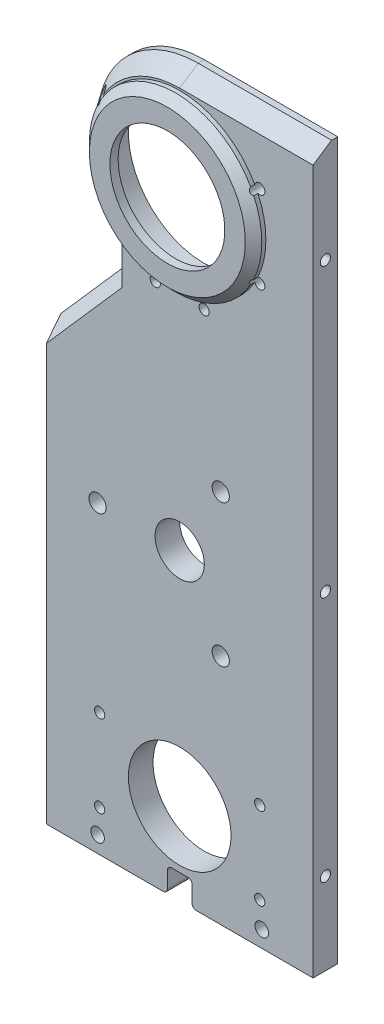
ISO-10303-21;
HEADER;
FILE_DESCRIPTION(('STEP AP214'),'2;1');
FILE_NAME('part.step','',(''),(''),'','','');
FILE_SCHEMA(('AUTOMOTIVE_DESIGN { 1 0 10303 214 1 1 1 1 }'));
ENDSEC;
DATA;
#1=APPLICATION_CONTEXT('core data for automotive mechanical design processes');
#2=APPLICATION_PROTOCOL_DEFINITION('international standard','automotive_design',2000,#1);
#3=PRODUCT_CONTEXT('',#1,'mechanical');
#4=PRODUCT('Part','Part','',(#3));
#5=PRODUCT_RELATED_PRODUCT_CATEGORY('part','',(#4));
#6=PRODUCT_DEFINITION_FORMATION('','',#4);
#7=PRODUCT_DEFINITION_CONTEXT('part definition',#1,'design');
#8=PRODUCT_DEFINITION('design','',#6,#7);
#9=PRODUCT_DEFINITION_SHAPE('','',#8);
#10=(LENGTH_UNIT() NAMED_UNIT(*) SI_UNIT(.MILLI.,.METRE.));
#11=(NAMED_UNIT(*) PLANE_ANGLE_UNIT() SI_UNIT($,.RADIAN.));
#12=(NAMED_UNIT(*) SI_UNIT($,.STERADIAN.) SOLID_ANGLE_UNIT());
#13=UNCERTAINTY_MEASURE_WITH_UNIT(LENGTH_MEASURE(1.E-05),#10,'distance_accuracy_value','');
#14=(GEOMETRIC_REPRESENTATION_CONTEXT(3) GLOBAL_UNCERTAINTY_ASSIGNED_CONTEXT((#13)) GLOBAL_UNIT_ASSIGNED_CONTEXT((#10,
#11,#12)) REPRESENTATION_CONTEXT('',''));
#15=CARTESIAN_POINT('',(0.,0.,0.));
#16=DIRECTION('',(0.,0.,1.));
#17=DIRECTION('',(1.,0.,0.));
#18=AXIS2_PLACEMENT_3D('',#15,#16,#17);
#19=CARTESIAN_POINT('',(-32.5,-150.,-43.));
#20=DIRECTION('',(0.,1.,0.));
#21=DIRECTION('',(0.,0.,-1.));
#22=AXIS2_PLACEMENT_3D('',#19,#20,#21);
#23=PLANE('',#22);
#24=DIRECTION('',(1.,0.,0.));
#25=VECTOR('',#24,1.);
#26=CARTESIAN_POINT('',(-32.5,-150.,-43.));
#27=LINE('',#26,#25);
#28=CARTESIAN_POINT('',(4.,-150.,-43.));
#29=VERTEX_POINT('',#28);
#30=CARTESIAN_POINT('',(32.5,-150.,-43.));
#31=VERTEX_POINT('',#30);
#32=EDGE_CURVE('E459',#29,#31,#27,.T.);
#33=ORIENTED_EDGE('',*,*,#32,.T.);
#34=DIRECTION('',(0.,0.,1.));
#35=VECTOR('',#34,1.);
#36=CARTESIAN_POINT('',(32.5,-150.,-43.));
#37=LINE('',#36,#35);
#38=CARTESIAN_POINT('',(32.5,-150.,-37.));
#39=VERTEX_POINT('',#38);
#40=EDGE_CURVE('E463',#31,#39,#37,.T.);
#41=ORIENTED_EDGE('',*,*,#40,.T.);
#42=DIRECTION('',(1.,0.,0.));
#43=VECTOR('',#42,1.);
#44=CARTESIAN_POINT('',(-32.5,-150.,-37.));
#45=LINE('',#44,#43);
#46=CARTESIAN_POINT('',(4.,-150.,-37.));
#47=VERTEX_POINT('',#46);
#48=EDGE_CURVE('E469',#47,#39,#45,.T.);
#49=ORIENTED_EDGE('',*,*,#48,.F.);
#50=DIRECTION('',(0.,0.,1.));
#51=VECTOR('',#50,1.);
#52=CARTESIAN_POINT('',(4.,-150.,-43.));
#53=LINE('',#52,#51);
#54=EDGE_CURVE('E1269',#29,#47,#53,.T.);
#55=ORIENTED_EDGE('',*,*,#54,.F.);
#56=EDGE_LOOP('',(#33,#41,#49,#55));
#57=FACE_BOUND('',#56,.T.);
#58=ADVANCED_FACE('F38',(#57),#23,.F.);
#59=CARTESIAN_POINT('',(20.,-146.,-34.));
#60=DIRECTION('',(0.,0.,-1.));
#61=DIRECTION('',(1.,0.,0.));
#62=AXIS2_PLACEMENT_3D('',#59,#60,#61);
#63=CYLINDRICAL_SURFACE('',#62,1.65000000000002);
#64=CARTESIAN_POINT('',(20.,-146.,-37.));
#65=DIRECTION('',(0.,0.,-1.));
#66=DIRECTION('',(-1.,0.,0.));
#67=AXIS2_PLACEMENT_3D('',#64,#65,#66);
#68=CIRCLE('',#67,1.65000000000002);
#69=CARTESIAN_POINT('',(18.35,-146.,-37.));
#70=VERTEX_POINT('',#69);
#71=EDGE_CURVE('E323',#70,#70,#68,.T.);
#72=ORIENTED_EDGE('',*,*,#71,.F.);
#73=EDGE_LOOP('',(#72));
#74=FACE_BOUND('',#73,.T.);
#75=CARTESIAN_POINT('',(20.,-146.,-40.1));
#76=DIRECTION('',(0.,0.,1.));
#77=DIRECTION('',(1.,0.,0.));
#78=AXIS2_PLACEMENT_3D('',#75,#76,#77);
#79=CIRCLE('',#78,1.65000000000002);
#80=CARTESIAN_POINT('',(21.65,-146.,-40.1));
#81=VERTEX_POINT('',#80);
#82=EDGE_CURVE('E308',#81,#81,#79,.T.);
#83=ORIENTED_EDGE('',*,*,#82,.F.);
#84=EDGE_LOOP('',(#83));
#85=FACE_BOUND('',#84,.T.);
#86=ADVANCED_FACE('F544',(#74,#85),#63,.F.);
#87=CARTESIAN_POINT('',(-20.,-146.,-34.));
#88=DIRECTION('',(0.,0.,-1.));
#89=DIRECTION('',(1.,0.,0.));
#90=AXIS2_PLACEMENT_3D('',#87,#88,#89);
#91=CYLINDRICAL_SURFACE('',#90,1.65000000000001);
#92=CARTESIAN_POINT('',(-20.,-146.,-37.));
#93=DIRECTION('',(0.,0.,-1.));
#94=DIRECTION('',(-1.,0.,0.));
#95=AXIS2_PLACEMENT_3D('',#92,#93,#94);
#96=CIRCLE('',#95,1.65000000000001);
#97=CARTESIAN_POINT('',(-21.65,-146.,-37.));
#98=VERTEX_POINT('',#97);
#99=EDGE_CURVE('E328',#98,#98,#96,.T.);
#100=ORIENTED_EDGE('',*,*,#99,.F.);
#101=EDGE_LOOP('',(#100));
#102=FACE_BOUND('',#101,.T.);
#103=CARTESIAN_POINT('',(-20.,-146.,-40.1));
#104=DIRECTION('',(0.,0.,1.));
#105=DIRECTION('',(1.,0.,0.));
#106=AXIS2_PLACEMENT_3D('',#103,#104,#105);
#107=CIRCLE('',#106,1.65000000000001);
#108=CARTESIAN_POINT('',(-18.35,-146.,-40.1));
#109=VERTEX_POINT('',#108);
#110=EDGE_CURVE('E317',#109,#109,#107,.T.);
#111=ORIENTED_EDGE('',*,*,#110,.F.);
#112=EDGE_LOOP('',(#111));
#113=FACE_BOUND('',#112,.T.);
#114=ADVANCED_FACE('F551',(#102,#113),#91,.F.);
#115=CARTESIAN_POINT('',(0.,0.,-37.));
#116=DIRECTION('',(0.,0.,1.));
#117=DIRECTION('',(-1.,0.,0.));
#118=AXIS2_PLACEMENT_3D('',#115,#116,#117);
#119=PLANE('',#118);
#120=CARTESIAN_POINT('',(-19.5,-10.,-37.));
#121=DIRECTION('',(0.,0.,-1.));
#122=DIRECTION('',(-1.,0.,0.));
#123=AXIS2_PLACEMENT_3D('',#120,#121,#122);
#124=CIRCLE('',#123,1.24999999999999);
#125=CARTESIAN_POINT('',(-19.6356380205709,-8.75738085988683,-37.));
#126=VERTEX_POINT('',#125);
#127=CARTESIAN_POINT('',(-19.0519585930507,-8.83305574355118,-37.));
#128=VERTEX_POINT('',#127);
#129=EDGE_CURVE('E415',#126,#128,#124,.T.);
#130=ORIENTED_EDGE('',*,*,#129,.T.);
#131=CARTESIAN_POINT('',(0.,0.,-37.));
#132=DIRECTION('',(0.,0.,-1.));
#133=DIRECTION('',(-1.,0.,0.));
#134=AXIS2_PLACEMENT_3D('',#131,#132,#133);
#135=CIRCLE('',#134,21.);
#136=CARTESIAN_POINT('',(-19.0519585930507,8.83305574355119,-37.));
#137=VERTEX_POINT('',#136);
#138=EDGE_CURVE('E426',#128,#137,#135,.T.);
#139=ORIENTED_EDGE('',*,*,#138,.T.);
#140=CARTESIAN_POINT('',(-19.5,10.,-37.));
#141=DIRECTION('',(0.,0.,-1.));
#142=DIRECTION('',(-1.,0.,0.));
#143=AXIS2_PLACEMENT_3D('',#140,#141,#142);
#144=CIRCLE('',#143,1.24999999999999);
#145=CARTESIAN_POINT('',(-19.6356380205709,8.75738085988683,-37.));
#146=VERTEX_POINT('',#145);
#147=EDGE_CURVE('E382',#137,#146,#144,.T.);
#148=ORIENTED_EDGE('',*,*,#147,.T.);
#149=CARTESIAN_POINT('',(0.,0.,-37.));
#150=DIRECTION('',(0.,0.,-1.));
#151=DIRECTION('',(-1.,0.,0.));
#152=AXIS2_PLACEMENT_3D('',#149,#150,#151);
#153=CIRCLE('',#152,21.5);
#154=EDGE_CURVE('E694',#126,#146,#153,.T.);
#155=ORIENTED_EDGE('',*,*,#154,.F.);
#156=EDGE_LOOP('',(#130,#139,#148,#155));
#157=FACE_BOUND('',#156,.T.);
#158=ADVANCED_FACE('F773',(#157),#119,.T.);
#159=CARTESIAN_POINT('',(5.95283803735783,-22.2162940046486,-37.));
#160=DIRECTION('',(0.,0.,1.));
#161=DIRECTION('',(1.,0.,0.));
#162=AXIS2_PLACEMENT_3D('',#159,#160,#161);
#163=CIRCLE('',#162,1.24999999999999);
#164=CARTESIAN_POINT('',(7.20283803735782,-22.2162940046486,-37.));
#165=VERTEX_POINT('',#164);
#166=EDGE_CURVE('E274',#165,#165,#163,.T.);
#167=ORIENTED_EDGE('',*,*,#166,.F.);
#168=EDGE_LOOP('',(#167));
#169=FACE_BOUND('',#168,.T.);
#170=CARTESIAN_POINT('',(-5.952838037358,-22.2162940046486,-37.));
#171=DIRECTION('',(0.,0.,1.));
#172=DIRECTION('',(1.,0.,0.));
#173=AXIS2_PLACEMENT_3D('',#170,#171,#172);
#174=CIRCLE('',#173,1.24999999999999);
#175=CARTESIAN_POINT('',(-4.70283803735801,-22.2162940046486,-37.));
#176=VERTEX_POINT('',#175);
#177=EDGE_CURVE('E280',#176,#176,#174,.T.);
#178=ORIENTED_EDGE('',*,*,#177,.F.);
#179=EDGE_LOOP('',(#178));
#180=FACE_BOUND('',#179,.T.);
#181=CARTESIAN_POINT('',(0.,-76.,-37.));
#182=DIRECTION('',(0.,0.,1.));
#183=DIRECTION('',(1.,0.,0.));
#184=AXIS2_PLACEMENT_3D('',#181,#182,#183);
#185=CIRCLE('',#184,6.);
#186=CARTESIAN_POINT('',(6.,-76.,-37.));
#187=VERTEX_POINT('',#186);
#188=EDGE_CURVE('E287',#187,#187,#185,.T.);
#189=ORIENTED_EDGE('',*,*,#188,.F.);
#190=EDGE_LOOP('',(#189));
#191=FACE_BOUND('',#190,.T.);
#192=ORIENTED_EDGE('',*,*,#48,.T.);
#193=DIRECTION('',(0.,1.,0.));
#194=VECTOR('',#193,1.);
#195=CARTESIAN_POINT('',(32.5,-150.,-37.));
#196=LINE('',#195,#194);
#197=CARTESIAN_POINT('',(32.5,21.5,-37.));
#198=VERTEX_POINT('',#197);
#199=EDGE_CURVE('E451',#39,#198,#196,.T.);
#200=ORIENTED_EDGE('',*,*,#199,.T.);
#201=DIRECTION('',(1.,0.,0.));
#202=VECTOR('',#201,1.);
#203=CARTESIAN_POINT('',(32.5,21.5,-37.));
#204=LINE('',#203,#202);
#205=CARTESIAN_POINT('',(0.,21.5,-37.));
#206=VERTEX_POINT('',#205);
#207=EDGE_CURVE('E691',#206,#198,#204,.T.);
#208=ORIENTED_EDGE('',*,*,#207,.F.);
#209=CARTESIAN_POINT('',(0.,0.,-37.));
#210=DIRECTION('',(0.,0.,-1.));
#211=DIRECTION('',(-1.,0.,0.));
#212=AXIS2_PLACEMENT_3D('',#209,#210,#211);
#213=CIRCLE('',#212,21.5);
#214=CARTESIAN_POINT('',(-18.5700491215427,10.8352792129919,-37.));
#215=VERTEX_POINT('',#214);
#216=EDGE_CURVE('E688',#215,#206,#213,.T.);
#217=ORIENTED_EDGE('',*,*,#216,.F.);
#218=CARTESIAN_POINT('',(-18.2908966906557,10.3171264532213,-37.));
#219=VERTEX_POINT('',#218);
#220=EDGE_CURVE('E381',#215,#219,#144,.T.);
#221=ORIENTED_EDGE('',*,*,#220,.T.);
#222=CARTESIAN_POINT('',(18.2908966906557,10.3171264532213,-37.));
#223=VERTEX_POINT('',#222);
#224=EDGE_CURVE('E430',#219,#223,#135,.T.);
#225=ORIENTED_EDGE('',*,*,#224,.T.);
#226=CARTESIAN_POINT('',(19.5,10.,-37.));
#227=DIRECTION('',(0.,0.,-1.));
#228=DIRECTION('',(-1.,0.,0.));
#229=AXIS2_PLACEMENT_3D('',#226,#227,#228);
#230=CIRCLE('',#229,1.24999999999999);
#231=CARTESIAN_POINT('',(19.0519585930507,8.83305574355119,-37.));
#232=VERTEX_POINT('',#231);
#233=EDGE_CURVE('E393',#223,#232,#230,.T.);
#234=ORIENTED_EDGE('',*,*,#233,.T.);
#235=CARTESIAN_POINT('',(19.0519585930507,-8.8330557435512,-37.));
#236=VERTEX_POINT('',#235);
#237=EDGE_CURVE('E1290',#232,#236,#135,.T.);
#238=ORIENTED_EDGE('',*,*,#237,.T.);
#239=CARTESIAN_POINT('',(19.5,-10.,-37.));
#240=DIRECTION('',(0.,0.,-1.));
#241=DIRECTION('',(-1.,0.,0.));
#242=AXIS2_PLACEMENT_3D('',#239,#240,#241);
#243=CIRCLE('',#242,1.24999999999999);
#244=CARTESIAN_POINT('',(18.2908966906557,-10.3171264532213,-37.));
#245=VERTEX_POINT('',#244);
#246=EDGE_CURVE('E404',#236,#245,#243,.T.);
#247=ORIENTED_EDGE('',*,*,#246,.T.);
#248=CARTESIAN_POINT('',(-18.2908966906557,-10.3171264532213,-37.));
#249=VERTEX_POINT('',#248);
#250=EDGE_CURVE('E423',#245,#249,#135,.T.);
#251=ORIENTED_EDGE('',*,*,#250,.T.);
#252=CARTESIAN_POINT('',(-18.5700491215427,-10.8352792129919,-37.));
#253=VERTEX_POINT('',#252);
#254=EDGE_CURVE('E416',#249,#253,#124,.T.);
#255=ORIENTED_EDGE('',*,*,#254,.T.);
#256=CARTESIAN_POINT('',(0.,0.,-37.));
#257=DIRECTION('',(0.,0.,-1.));
#258=DIRECTION('',(-1.,0.,0.));
#259=AXIS2_PLACEMENT_3D('',#256,#257,#258);
#260=CIRCLE('',#259,21.5);
#261=CARTESIAN_POINT('',(-14.0526226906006,-16.2718712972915,-37.));
#262=VERTEX_POINT('',#261);
#263=EDGE_CURVE('E685',#262,#253,#260,.T.);
#264=ORIENTED_EDGE('',*,*,#263,.F.);
#265=DIRECTION('',(0.,1.,0.));
#266=VECTOR('',#265,1.);
#267=CARTESIAN_POINT('',(-14.0526226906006,0.,-37.));
#268=LINE('',#267,#266);
#269=CARTESIAN_POINT('',(-14.0526226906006,-27.6148869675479,-37.));
#270=VERTEX_POINT('',#269);
#271=EDGE_CURVE('E346',#270,#262,#268,.T.);
#272=ORIENTED_EDGE('',*,*,#271,.F.);
#273=DIRECTION('',(0.659969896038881,0.751292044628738,0.));
#274=VECTOR('',#273,1.);
#275=CARTESIAN_POINT('',(5.76043442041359,-5.06023367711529,-37.));
#276=LINE('',#275,#274);
#277=CARTESIAN_POINT('',(-32.5,-48.6148869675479,-37.));
#278=VERTEX_POINT('',#277);
#279=EDGE_CURVE('E580',#278,#270,#276,.T.);
#280=ORIENTED_EDGE('',*,*,#279,.F.);
#281=DIRECTION('',(0.,-1.,0.));
#282=VECTOR('',#281,1.);
#283=CARTESIAN_POINT('',(-32.5,-150.,-37.));
#284=LINE('',#283,#282);
#285=CARTESIAN_POINT('',(-32.5,-150.,-37.));
#286=VERTEX_POINT('',#285);
#287=EDGE_CURVE('E466',#278,#286,#284,.T.);
#288=ORIENTED_EDGE('',*,*,#287,.T.);
#289=CARTESIAN_POINT('',(-4.,-150.,-37.));
#290=VERTEX_POINT('',#289);
#291=EDGE_CURVE('E456',#286,#290,#45,.T.);
#292=ORIENTED_EDGE('',*,*,#291,.T.);
#293=CARTESIAN_POINT('',(-4.,-149.,-37.));
#294=DIRECTION('',(0.,0.,-1.));
#295=DIRECTION('',(-1.,0.,0.));
#296=AXIS2_PLACEMENT_3D('',#293,#294,#295);
#297=CIRCLE('',#296,1.);
#298=CARTESIAN_POINT('',(-3.,-149.,-37.));
#299=VERTEX_POINT('',#298);
#300=EDGE_CURVE('E1312',#299,#290,#297,.T.);
#301=ORIENTED_EDGE('',*,*,#300,.F.);
#302=DIRECTION('',(0.,1.,0.));
#303=VECTOR('',#302,1.);
#304=CARTESIAN_POINT('',(-3.00000000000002,0.,-37.));
#305=LINE('',#304,#303);
#306=CARTESIAN_POINT('',(-3.,-145.,-37.));
#307=VERTEX_POINT('',#306);
#308=EDGE_CURVE('E298',#299,#307,#305,.T.);
#309=ORIENTED_EDGE('',*,*,#308,.T.);
#310=CARTESIAN_POINT('',(-2.,-145.,-37.));
#311=DIRECTION('',(0.,0.,-1.));
#312=DIRECTION('',(-1.,0.,0.));
#313=AXIS2_PLACEMENT_3D('',#310,#311,#312);
#314=CIRCLE('',#313,1.);
#315=CARTESIAN_POINT('',(-2.,-144.,-37.));
#316=VERTEX_POINT('',#315);
#317=EDGE_CURVE('E619',#316,#307,#314,.F.);
#318=ORIENTED_EDGE('',*,*,#317,.F.);
#319=DIRECTION('',(1.,0.,0.));
#320=VECTOR('',#319,1.);
#321=CARTESIAN_POINT('',(0.,-144.,-37.));
#322=LINE('',#321,#320);
#323=CARTESIAN_POINT('',(2.,-144.,-37.));
#324=VERTEX_POINT('',#323);
#325=EDGE_CURVE('E304',#316,#324,#322,.T.);
#326=ORIENTED_EDGE('',*,*,#325,.T.);
#327=CARTESIAN_POINT('',(2.,-145.,-37.));
#328=DIRECTION('',(0.,0.,-1.));
#329=DIRECTION('',(-1.,0.,0.));
#330=AXIS2_PLACEMENT_3D('',#327,#328,#329);
#331=CIRCLE('',#330,1.);
#332=CARTESIAN_POINT('',(3.,-145.,-37.));
#333=VERTEX_POINT('',#332);
#334=EDGE_CURVE('E614',#333,#324,#331,.F.);
#335=ORIENTED_EDGE('',*,*,#334,.F.);
#336=DIRECTION('',(0.,-1.,0.));
#337=VECTOR('',#336,1.);
#338=CARTESIAN_POINT('',(3.,0.,-37.));
#339=LINE('',#338,#337);
#340=CARTESIAN_POINT('',(3.,-149.,-37.));
#341=VERTEX_POINT('',#340);
#342=EDGE_CURVE('E301',#333,#341,#339,.T.);
#343=ORIENTED_EDGE('',*,*,#342,.T.);
#344=CARTESIAN_POINT('',(4.,-149.,-37.));
#345=DIRECTION('',(0.,0.,-1.));
#346=DIRECTION('',(-1.,0.,0.));
#347=AXIS2_PLACEMENT_3D('',#344,#345,#346);
#348=CIRCLE('',#347,1.);
#349=EDGE_CURVE('E1265',#47,#341,#348,.T.);
#350=ORIENTED_EDGE('',*,*,#349,.F.);
#351=EDGE_LOOP('',(#192,#200,#208,#217,#221,#225,#234,#238,#247,#251,#255,#264,#272,#280,#288,
#292,#301,#309,#318,#326,#335,#343,#350));
#352=FACE_BOUND('',#351,.T.);
#353=ORIENTED_EDGE('',*,*,#71,.T.);
#354=EDGE_LOOP('',(#353));
#355=FACE_BOUND('',#354,.T.);
#356=ORIENTED_EDGE('',*,*,#99,.T.);
#357=EDGE_LOOP('',(#356));
#358=FACE_BOUND('',#357,.T.);
#359=CARTESIAN_POINT('',(0.,-130.,-37.));
#360=DIRECTION('',(0.,0.,-1.));
#361=DIRECTION('',(-1.,0.,0.));
#362=AXIS2_PLACEMENT_3D('',#359,#360,#361);
#363=CIRCLE('',#362,12.5);
#364=CARTESIAN_POINT('',(-12.5,-130.,-37.));
#365=VERTEX_POINT('',#364);
#366=EDGE_CURVE('E350',#365,#365,#363,.T.);
#367=ORIENTED_EDGE('',*,*,#366,.T.);
#368=EDGE_LOOP('',(#367));
#369=FACE_BOUND('',#368,.T.);
#370=CARTESIAN_POINT('',(-19.5,-120.,-37.));
#371=DIRECTION('',(0.,0.,-1.));
#372=DIRECTION('',(-1.,0.,0.));
#373=AXIS2_PLACEMENT_3D('',#370,#371,#372);
#374=CIRCLE('',#373,1.24999999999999);
#375=CARTESIAN_POINT('',(-20.75,-120.,-37.));
#376=VERTEX_POINT('',#375);
#377=EDGE_CURVE('E356',#376,#376,#374,.T.);
#378=ORIENTED_EDGE('',*,*,#377,.T.);
#379=EDGE_LOOP('',(#378));
#380=FACE_BOUND('',#379,.T.);
#381=CARTESIAN_POINT('',(19.5,-120.,-37.));
#382=DIRECTION('',(0.,0.,-1.));
#383=DIRECTION('',(-1.,0.,0.));
#384=AXIS2_PLACEMENT_3D('',#381,#382,#383);
#385=CIRCLE('',#384,1.24999999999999);
#386=CARTESIAN_POINT('',(18.25,-120.,-37.));
#387=VERTEX_POINT('',#386);
#388=EDGE_CURVE('E360',#387,#387,#385,.T.);
#389=ORIENTED_EDGE('',*,*,#388,.T.);
#390=EDGE_LOOP('',(#389));
#391=FACE_BOUND('',#390,.T.);
#392=CARTESIAN_POINT('',(-19.5,-140.,-37.));
#393=DIRECTION('',(0.,0.,-1.));
#394=DIRECTION('',(-1.,0.,0.));
#395=AXIS2_PLACEMENT_3D('',#392,#393,#394);
#396=CIRCLE('',#395,1.24999999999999);
#397=CARTESIAN_POINT('',(-20.75,-140.,-37.));
#398=VERTEX_POINT('',#397);
#399=EDGE_CURVE('E366',#398,#398,#396,.T.);
#400=ORIENTED_EDGE('',*,*,#399,.T.);
#401=EDGE_LOOP('',(#400));
#402=FACE_BOUND('',#401,.T.);
#403=CARTESIAN_POINT('',(19.5,-140.,-37.));
#404=DIRECTION('',(0.,0.,-1.));
#405=DIRECTION('',(-1.,0.,0.));
#406=AXIS2_PLACEMENT_3D('',#403,#404,#405);
#407=CIRCLE('',#406,1.24999999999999);
#408=CARTESIAN_POINT('',(18.25,-140.,-37.));
#409=VERTEX_POINT('',#408);
#410=EDGE_CURVE('E370',#409,#409,#407,.T.);
#411=ORIENTED_EDGE('',*,*,#410,.T.);
#412=EDGE_LOOP('',(#411));
#413=FACE_BOUND('',#412,.T.);
#414=CARTESIAN_POINT('',(-20.,-76.,-37.));
#415=DIRECTION('',(0.,0.,1.));
#416=DIRECTION('',(1.,0.,0.));
#417=AXIS2_PLACEMENT_3D('',#414,#415,#416);
#418=CIRCLE('',#417,2.1);
#419=CARTESIAN_POINT('',(-17.9,-76.,-37.));
#420=VERTEX_POINT('',#419);
#421=EDGE_CURVE('E445',#420,#420,#418,.T.);
#422=ORIENTED_EDGE('',*,*,#421,.F.);
#423=EDGE_LOOP('',(#422));
#424=FACE_BOUND('',#423,.T.);
#425=CARTESIAN_POINT('',(9.99999999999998,-93.3205080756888,-37.));
#426=DIRECTION('',(0.,0.,1.));
#427=DIRECTION('',(1.,0.,0.));
#428=AXIS2_PLACEMENT_3D('',#425,#426,#427);
#429=CIRCLE('',#428,2.1);
#430=CARTESIAN_POINT('',(12.1,-93.3205080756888,-37.));
#431=VERTEX_POINT('',#430);
#432=EDGE_CURVE('E435',#431,#431,#429,.T.);
#433=ORIENTED_EDGE('',*,*,#432,.F.);
#434=EDGE_LOOP('',(#433));
#435=FACE_BOUND('',#434,.T.);
#436=CARTESIAN_POINT('',(9.99999999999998,-58.6794919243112,-37.));
#437=DIRECTION('',(0.,0.,1.));
#438=DIRECTION('',(1.,0.,0.));
#439=AXIS2_PLACEMENT_3D('',#436,#437,#438);
#440=CIRCLE('',#439,2.1);
#441=CARTESIAN_POINT('',(12.1,-58.6794919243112,-37.));
#442=VERTEX_POINT('',#441);
#443=EDGE_CURVE('E434',#442,#442,#440,.T.);
#444=ORIENTED_EDGE('',*,*,#443,.F.);
#445=EDGE_LOOP('',(#444));
#446=FACE_BOUND('',#445,.T.);
#447=ADVANCED_FACE('F576',(#169,#180,#191,#352,#355,#358,#369,#380,#391,#402,#413,#424,#435,
#446),#119,.T.);
#448=CARTESIAN_POINT('',(0.,0.,-43.));
#449=DIRECTION('',(0.,0.,1.));
#450=DIRECTION('',(-1.,0.,0.));
#451=AXIS2_PLACEMENT_3D('',#448,#449,#450);
#452=PLANE('',#451);
#453=CARTESIAN_POINT('',(5.95283803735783,-22.2162940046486,-43.));
#454=DIRECTION('',(0.,0.,1.));
#455=DIRECTION('',(1.,0.,0.));
#456=AXIS2_PLACEMENT_3D('',#453,#454,#455);
#457=CIRCLE('',#456,1.24999999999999);
#458=CARTESIAN_POINT('',(7.20283803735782,-22.2162940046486,-43.));
#459=VERTEX_POINT('',#458);
#460=EDGE_CURVE('E277',#459,#459,#457,.T.);
#461=ORIENTED_EDGE('',*,*,#460,.T.);
#462=EDGE_LOOP('',(#461));
#463=FACE_BOUND('',#462,.T.);
#464=CARTESIAN_POINT('',(-5.952838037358,-22.2162940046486,-43.));
#465=DIRECTION('',(0.,0.,1.));
#466=DIRECTION('',(1.,0.,0.));
#467=AXIS2_PLACEMENT_3D('',#464,#465,#466);
#468=CIRCLE('',#467,1.24999999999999);
#469=CARTESIAN_POINT('',(-4.70283803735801,-22.2162940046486,-43.));
#470=VERTEX_POINT('',#469);
#471=EDGE_CURVE('E42',#470,#470,#468,.T.);
#472=ORIENTED_EDGE('',*,*,#471,.T.);
#473=EDGE_LOOP('',(#472));
#474=FACE_BOUND('',#473,.T.);
#475=CARTESIAN_POINT('',(0.,-76.,-43.));
#476=DIRECTION('',(0.,0.,1.));
#477=DIRECTION('',(1.,0.,0.));
#478=AXIS2_PLACEMENT_3D('',#475,#476,#477);
#479=CIRCLE('',#478,6.);
#480=CARTESIAN_POINT('',(6.,-76.,-43.));
#481=VERTEX_POINT('',#480);
#482=EDGE_CURVE('E283',#481,#481,#479,.T.);
#483=ORIENTED_EDGE('',*,*,#482,.T.);
#484=EDGE_LOOP('',(#483));
#485=FACE_BOUND('',#484,.T.);
#486=CARTESIAN_POINT('',(20.,-146.,-43.));
#487=DIRECTION('',(0.,0.,1.));
#488=DIRECTION('',(1.,0.,0.));
#489=AXIS2_PLACEMENT_3D('',#486,#487,#488);
#490=CIRCLE('',#489,3.);
#491=CARTESIAN_POINT('',(23.,-146.,-43.));
#492=VERTEX_POINT('',#491);
#493=EDGE_CURVE('E307',#492,#492,#490,.T.);
#494=ORIENTED_EDGE('',*,*,#493,.T.);
#495=EDGE_LOOP('',(#494));
#496=FACE_BOUND('',#495,.T.);
#497=CARTESIAN_POINT('',(-20.,-146.,-43.));
#498=DIRECTION('',(0.,0.,1.));
#499=DIRECTION('',(1.,0.,0.));
#500=AXIS2_PLACEMENT_3D('',#497,#498,#499);
#501=CIRCLE('',#500,3.);
#502=CARTESIAN_POINT('',(-17.,-146.,-43.));
#503=VERTEX_POINT('',#502);
#504=EDGE_CURVE('E314',#503,#503,#501,.T.);
#505=ORIENTED_EDGE('',*,*,#504,.T.);
#506=EDGE_LOOP('',(#505));
#507=FACE_BOUND('',#506,.T.);
#508=CARTESIAN_POINT('',(0.,0.,-43.));
#509=DIRECTION('',(0.,0.,1.));
#510=DIRECTION('',(1.,0.,0.));
#511=AXIS2_PLACEMENT_3D('',#508,#509,#510);
#512=CIRCLE('',#511,18.5);
#513=CARTESIAN_POINT('',(18.5,0.,-43.));
#514=VERTEX_POINT('',#513);
#515=EDGE_CURVE('E448',#514,#514,#512,.T.);
#516=ORIENTED_EDGE('',*,*,#515,.T.);
#517=EDGE_LOOP('',(#516));
#518=FACE_BOUND('',#517,.T.);
#519=CARTESIAN_POINT('',(-20.,-76.,-43.));
#520=DIRECTION('',(0.,0.,1.));
#521=DIRECTION('',(1.,0.,0.));
#522=AXIS2_PLACEMENT_3D('',#519,#520,#521);
#523=CIRCLE('',#522,2.1);
#524=CARTESIAN_POINT('',(-17.9,-76.,-43.));
#525=VERTEX_POINT('',#524);
#526=EDGE_CURVE('E438',#525,#525,#523,.T.);
#527=ORIENTED_EDGE('',*,*,#526,.T.);
#528=EDGE_LOOP('',(#527));
#529=FACE_BOUND('',#528,.T.);
#530=CARTESIAN_POINT('',(9.99999999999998,-93.3205080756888,-43.));
#531=DIRECTION('',(0.,0.,1.));
#532=DIRECTION('',(1.,0.,0.));
#533=AXIS2_PLACEMENT_3D('',#530,#531,#532);
#534=CIRCLE('',#533,2.1);
#535=CARTESIAN_POINT('',(12.1,-93.3205080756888,-43.));
#536=VERTEX_POINT('',#535);
#537=EDGE_CURVE('E429',#536,#536,#534,.T.);
#538=ORIENTED_EDGE('',*,*,#537,.T.);
#539=EDGE_LOOP('',(#538));
#540=FACE_BOUND('',#539,.T.);
#541=CARTESIAN_POINT('',(9.99999999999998,-58.6794919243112,-43.));
#542=DIRECTION('',(0.,0.,1.));
#543=DIRECTION('',(1.,0.,0.));
#544=AXIS2_PLACEMENT_3D('',#541,#542,#543);
#545=CIRCLE('',#544,2.1);
#546=CARTESIAN_POINT('',(12.1,-58.6794919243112,-43.));
#547=VERTEX_POINT('',#546);
#548=EDGE_CURVE('E431',#547,#547,#545,.T.);
#549=ORIENTED_EDGE('',*,*,#548,.T.);
#550=EDGE_LOOP('',(#549));
#551=FACE_BOUND('',#550,.T.);
#552=CARTESIAN_POINT('',(-19.5,-10.,-43.));
#553=DIRECTION('',(0.,0.,1.));
#554=DIRECTION('',(1.,0.,0.));
#555=AXIS2_PLACEMENT_3D('',#552,#553,#554);
#556=CIRCLE('',#555,1.24999999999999);
#557=CARTESIAN_POINT('',(-18.25,-10.,-43.));
#558=VERTEX_POINT('',#557);
#559=EDGE_CURVE('E407',#558,#558,#556,.T.);
#560=ORIENTED_EDGE('',*,*,#559,.T.);
#561=EDGE_LOOP('',(#560));
#562=FACE_BOUND('',#561,.T.);
#563=CARTESIAN_POINT('',(19.5,-10.,-43.));
#564=DIRECTION('',(0.,0.,1.));
#565=DIRECTION('',(1.,0.,0.));
#566=AXIS2_PLACEMENT_3D('',#563,#564,#565);
#567=CIRCLE('',#566,1.24999999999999);
#568=CARTESIAN_POINT('',(20.75,-10.,-43.));
#569=VERTEX_POINT('',#568);
#570=EDGE_CURVE('E396',#569,#569,#567,.T.);
#571=ORIENTED_EDGE('',*,*,#570,.T.);
#572=EDGE_LOOP('',(#571));
#573=FACE_BOUND('',#572,.T.);
#574=CARTESIAN_POINT('',(19.5,10.,-43.));
#575=DIRECTION('',(0.,0.,1.));
#576=DIRECTION('',(1.,0.,0.));
#577=AXIS2_PLACEMENT_3D('',#574,#575,#576);
#578=CIRCLE('',#577,1.24999999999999);
#579=CARTESIAN_POINT('',(20.75,10.,-43.));
#580=VERTEX_POINT('',#579);
#581=EDGE_CURVE('E385',#580,#580,#578,.T.);
#582=ORIENTED_EDGE('',*,*,#581,.T.);
#583=EDGE_LOOP('',(#582));
#584=FACE_BOUND('',#583,.T.);
#585=CARTESIAN_POINT('',(-19.5,10.,-43.));
#586=DIRECTION('',(0.,0.,1.));
#587=DIRECTION('',(1.,0.,0.));
#588=AXIS2_PLACEMENT_3D('',#585,#586,#587);
#589=CIRCLE('',#588,1.24999999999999);
#590=CARTESIAN_POINT('',(-18.25,10.,-43.));
#591=VERTEX_POINT('',#590);
#592=EDGE_CURVE('E373',#591,#591,#589,.T.);
#593=ORIENTED_EDGE('',*,*,#592,.T.);
#594=EDGE_LOOP('',(#593));
#595=FACE_BOUND('',#594,.T.);
#596=CARTESIAN_POINT('',(19.5,-140.,-43.));
#597=DIRECTION('',(0.,0.,1.));
#598=DIRECTION('',(1.,0.,0.));
#599=AXIS2_PLACEMENT_3D('',#596,#597,#598);
#600=CIRCLE('',#599,1.24999999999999);
#601=CARTESIAN_POINT('',(20.75,-140.,-43.));
#602=VERTEX_POINT('',#601);
#603=EDGE_CURVE('E367',#602,#602,#600,.T.);
#604=ORIENTED_EDGE('',*,*,#603,.T.);
#605=EDGE_LOOP('',(#604));
#606=FACE_BOUND('',#605,.T.);
#607=CARTESIAN_POINT('',(-19.5,-140.,-43.));
#608=DIRECTION('',(0.,0.,1.));
#609=DIRECTION('',(1.,0.,0.));
#610=AXIS2_PLACEMENT_3D('',#607,#608,#609);
#611=CIRCLE('',#610,1.24999999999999);
#612=CARTESIAN_POINT('',(-18.25,-140.,-43.));
#613=VERTEX_POINT('',#612);
#614=EDGE_CURVE('E363',#613,#613,#611,.T.);
#615=ORIENTED_EDGE('',*,*,#614,.T.);
#616=EDGE_LOOP('',(#615));
#617=FACE_BOUND('',#616,.T.);
#618=CARTESIAN_POINT('',(19.5,-120.,-43.));
#619=DIRECTION('',(0.,0.,1.));
#620=DIRECTION('',(1.,0.,0.));
#621=AXIS2_PLACEMENT_3D('',#618,#619,#620);
#622=CIRCLE('',#621,1.24999999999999);
#623=CARTESIAN_POINT('',(20.75,-120.,-43.));
#624=VERTEX_POINT('',#623);
#625=EDGE_CURVE('E357',#624,#624,#622,.T.);
#626=ORIENTED_EDGE('',*,*,#625,.T.);
#627=EDGE_LOOP('',(#626));
#628=FACE_BOUND('',#627,.T.);
#629=CARTESIAN_POINT('',(-19.5,-120.,-43.));
#630=DIRECTION('',(0.,0.,1.));
#631=DIRECTION('',(1.,0.,0.));
#632=AXIS2_PLACEMENT_3D('',#629,#630,#631);
#633=CIRCLE('',#632,1.24999999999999);
#634=CARTESIAN_POINT('',(-18.25,-120.,-43.));
#635=VERTEX_POINT('',#634);
#636=EDGE_CURVE('E353',#635,#635,#633,.T.);
#637=ORIENTED_EDGE('',*,*,#636,.T.);
#638=EDGE_LOOP('',(#637));
#639=FACE_BOUND('',#638,.T.);
#640=CARTESIAN_POINT('',(0.,-130.,-43.));
#641=DIRECTION('',(0.,0.,-1.));
#642=DIRECTION('',(-1.,0.,0.));
#643=AXIS2_PLACEMENT_3D('',#640,#641,#642);
#644=CIRCLE('',#643,12.5);
#645=CARTESIAN_POINT('',(-12.5,-130.,-43.));
#646=VERTEX_POINT('',#645);
#647=EDGE_CURVE('E349',#646,#646,#644,.T.);
#648=ORIENTED_EDGE('',*,*,#647,.F.);
#649=EDGE_LOOP('',(#648));
#650=FACE_BOUND('',#649,.T.);
#651=DIRECTION('',(0.,1.,0.));
#652=VECTOR('',#651,1.);
#653=CARTESIAN_POINT('',(3.,-144.,-43.));
#654=LINE('',#653,#652);
#655=CARTESIAN_POINT('',(3.,-149.,-43.));
#656=VERTEX_POINT('',#655);
#657=CARTESIAN_POINT('',(3.,-145.,-43.));
#658=VERTEX_POINT('',#657);
#659=EDGE_CURVE('E286',#656,#658,#654,.T.);
#660=ORIENTED_EDGE('',*,*,#659,.T.);
#661=CARTESIAN_POINT('',(2.,-145.,-43.));
#662=DIRECTION('',(0.,0.,-1.));
#663=DIRECTION('',(-1.,0.,0.));
#664=AXIS2_PLACEMENT_3D('',#661,#662,#663);
#665=CIRCLE('',#664,1.);
#666=CARTESIAN_POINT('',(2.,-144.,-43.));
#667=VERTEX_POINT('',#666);
#668=EDGE_CURVE('E611',#667,#658,#665,.T.);
#669=ORIENTED_EDGE('',*,*,#668,.F.);
#670=DIRECTION('',(-1.,0.,0.));
#671=VECTOR('',#670,1.);
#672=CARTESIAN_POINT('',(-3.,-144.,-43.));
#673=LINE('',#672,#671);
#674=CARTESIAN_POINT('',(-2.,-144.,-43.));
#675=VERTEX_POINT('',#674);
#676=EDGE_CURVE('E292',#667,#675,#673,.T.);
#677=ORIENTED_EDGE('',*,*,#676,.T.);
#678=CARTESIAN_POINT('',(-2.,-145.,-43.));
#679=DIRECTION('',(0.,0.,-1.));
#680=DIRECTION('',(-1.,0.,0.));
#681=AXIS2_PLACEMENT_3D('',#678,#679,#680);
#682=CIRCLE('',#681,1.);
#683=CARTESIAN_POINT('',(-3.,-145.,-43.));
#684=VERTEX_POINT('',#683);
#685=EDGE_CURVE('E617',#684,#675,#682,.T.);
#686=ORIENTED_EDGE('',*,*,#685,.F.);
#687=DIRECTION('',(0.,-1.,0.));
#688=VECTOR('',#687,1.);
#689=CARTESIAN_POINT('',(-3.,-144.,-43.));
#690=LINE('',#689,#688);
#691=CARTESIAN_POINT('',(-3.,-149.,-43.));
#692=VERTEX_POINT('',#691);
#693=EDGE_CURVE('E295',#684,#692,#690,.T.);
#694=ORIENTED_EDGE('',*,*,#693,.T.);
#695=CARTESIAN_POINT('',(-4.,-149.,-43.));
#696=DIRECTION('',(0.,0.,-1.));
#697=DIRECTION('',(-1.,0.,0.));
#698=AXIS2_PLACEMENT_3D('',#695,#696,#697);
#699=CIRCLE('',#698,1.);
#700=CARTESIAN_POINT('',(-4.,-150.,-43.));
#701=VERTEX_POINT('',#700);
#702=EDGE_CURVE('E593',#701,#692,#699,.F.);
#703=ORIENTED_EDGE('',*,*,#702,.F.);
#704=CARTESIAN_POINT('',(-32.5,-150.,-43.));
#705=VERTEX_POINT('',#704);
#706=EDGE_CURVE('E460',#705,#701,#27,.T.);
#707=ORIENTED_EDGE('',*,*,#706,.F.);
#708=DIRECTION('',(0.,-1.,0.));
#709=VECTOR('',#708,1.);
#710=CARTESIAN_POINT('',(-32.5,-150.,-43.));
#711=LINE('',#710,#709);
#712=CARTESIAN_POINT('',(-32.5,-44.0692250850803,-43.));
#713=VERTEX_POINT('',#712);
#714=EDGE_CURVE('E455',#713,#705,#711,.T.);
#715=ORIENTED_EDGE('',*,*,#714,.F.);
#716=DIRECTION('',(0.659969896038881,0.751292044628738,0.));
#717=VECTOR('',#716,1.);
#718=CARTESIAN_POINT('',(3.50655828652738,-3.08032398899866,-43.));
#719=LINE('',#718,#717);
#720=CARTESIAN_POINT('',(-14.0526226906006,-23.0692250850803,-43.));
#721=VERTEX_POINT('',#720);
#722=EDGE_CURVE('E340',#713,#721,#719,.T.);
#723=ORIENTED_EDGE('',*,*,#722,.T.);
#724=DIRECTION('',(0.,1.,0.));
#725=VECTOR('',#724,1.);
#726=CARTESIAN_POINT('',(-14.0526226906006,0.,-43.));
#727=LINE('',#726,#725);
#728=CARTESIAN_POINT('',(-14.0526226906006,-20.0692250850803,-43.));
#729=VERTEX_POINT('',#728);
#730=EDGE_CURVE('E677',#721,#729,#727,.T.);
#731=ORIENTED_EDGE('',*,*,#730,.T.);
#732=CARTESIAN_POINT('',(0.,0.,-43.));
#733=DIRECTION('',(0.,0.,1.));
#734=DIRECTION('',(1.,0.,0.));
#735=AXIS2_PLACEMENT_3D('',#732,#733,#734);
#736=CIRCLE('',#735,24.5);
#737=CARTESIAN_POINT('',(0.,24.5,-43.));
#738=VERTEX_POINT('',#737);
#739=EDGE_CURVE('E676',#729,#738,#736,.F.);
#740=ORIENTED_EDGE('',*,*,#739,.T.);
#741=DIRECTION('',(-1.,0.,0.));
#742=VECTOR('',#741,1.);
#743=CARTESIAN_POINT('',(0.,24.5,-43.));
#744=LINE('',#743,#742);
#745=CARTESIAN_POINT('',(32.5,24.5,-43.));
#746=VERTEX_POINT('',#745);
#747=EDGE_CURVE('E343',#746,#738,#744,.T.);
#748=ORIENTED_EDGE('',*,*,#747,.F.);
#749=DIRECTION('',(0.,1.,0.));
#750=VECTOR('',#749,1.);
#751=CARTESIAN_POINT('',(32.5,-150.,-43.));
#752=LINE('',#751,#750);
#753=EDGE_CURVE('E452',#31,#746,#752,.T.);
#754=ORIENTED_EDGE('',*,*,#753,.F.);
#755=ORIENTED_EDGE('',*,*,#32,.F.);
#756=CARTESIAN_POINT('',(4.,-149.,-43.));
#757=DIRECTION('',(0.,0.,-1.));
#758=DIRECTION('',(-1.,0.,0.));
#759=AXIS2_PLACEMENT_3D('',#756,#757,#758);
#760=CIRCLE('',#759,1.);
#761=EDGE_CURVE('E596',#656,#29,#760,.F.);
#762=ORIENTED_EDGE('',*,*,#761,.F.);
#763=EDGE_LOOP('',(#660,#669,#677,#686,#694,#703,#707,#715,#723,#731,#740,#748,#754,#755,#762));
#764=FACE_BOUND('',#763,.T.);
#765=ADVANCED_FACE('F592',(#463,#474,#485,#496,#507,#518,#529,#540,#551,#562,#573,#584,#595,
#606,#617,#628,#639,#650,#764),#452,.F.);
#766=CARTESIAN_POINT('',(-32.5,-150.,-43.));
#767=DIRECTION('',(1.,0.,0.));
#768=DIRECTION('',(0.,1.,0.));
#769=AXIS2_PLACEMENT_3D('',#766,#767,#768);
#770=PLANE('',#769);
#771=CARTESIAN_POINT('',(-32.5,-130.,-40.));
#772=DIRECTION('',(-1.,0.,0.));
#773=DIRECTION('',(0.,0.,1.));
#774=AXIS2_PLACEMENT_3D('',#771,#772,#773);
#775=CIRCLE('',#774,1.25);
#776=CARTESIAN_POINT('',(-32.5,-130.,-38.75));
#777=VERTEX_POINT('',#776);
#778=EDGE_CURVE('E246',#777,#777,#775,.T.);
#779=ORIENTED_EDGE('',*,*,#778,.F.);
#780=EDGE_LOOP('',(#779));
#781=FACE_BOUND('',#780,.T.);
#782=CARTESIAN_POINT('',(-32.5,-70.,-40.));
#783=DIRECTION('',(-1.,0.,0.));
#784=DIRECTION('',(0.,0.,1.));
#785=AXIS2_PLACEMENT_3D('',#782,#783,#784);
#786=CIRCLE('',#785,1.24999999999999);
#787=CARTESIAN_POINT('',(-32.5,-70.,-38.75));
#788=VERTEX_POINT('',#787);
#789=EDGE_CURVE('E245',#788,#788,#786,.T.);
#790=ORIENTED_EDGE('',*,*,#789,.F.);
#791=EDGE_LOOP('',(#790));
#792=FACE_BOUND('',#791,.T.);
#793=DIRECTION('',(0.,0.,-1.));
#794=VECTOR('',#793,1.);
#795=CARTESIAN_POINT('',(-32.5,-44.0692250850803,-43.));
#796=LINE('',#795,#794);
#797=CARTESIAN_POINT('',(-32.5,-44.0692250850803,-40.5752607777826));
#798=VERTEX_POINT('',#797);
#799=EDGE_CURVE('E588',#798,#713,#796,.T.);
#800=ORIENTED_EDGE('',*,*,#799,.T.);
#801=ORIENTED_EDGE('',*,*,#714,.T.);
#802=DIRECTION('',(0.,0.,1.));
#803=VECTOR('',#802,1.);
#804=CARTESIAN_POINT('',(-32.5,-150.,-43.));
#805=LINE('',#804,#803);
#806=EDGE_CURVE('E474',#705,#286,#805,.T.);
#807=ORIENTED_EDGE('',*,*,#806,.T.);
#808=ORIENTED_EDGE('',*,*,#287,.F.);
#809=DIRECTION('',(0.,0.786010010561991,-0.618213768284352));
#810=VECTOR('',#809,1.);
#811=CARTESIAN_POINT('',(-32.5,-21.7063109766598,-58.1641734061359));
#812=LINE('',#811,#810);
#813=EDGE_CURVE('E584',#798,#278,#812,.F.);
#814=ORIENTED_EDGE('',*,*,#813,.F.);
#815=EDGE_LOOP('',(#800,#801,#807,#808,#814));
#816=FACE_BOUND('',#815,.T.);
#817=ADVANCED_FACE('F583',(#781,#792,#816),#770,.F.);
#818=CARTESIAN_POINT('',(0.,0.,-36.));
#819=DIRECTION('',(0.,0.,-1.));
#820=DIRECTION('',(1.,0.,0.));
#821=AXIS2_PLACEMENT_3D('',#818,#819,#820);
#822=CYLINDRICAL_SURFACE('',#821,21.);
#823=ORIENTED_EDGE('',*,*,#138,.F.);
#824=DIRECTION('',(0.,0.,-1.));
#825=VECTOR('',#824,1.);
#826=CARTESIAN_POINT('',(-19.0519585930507,-8.83305574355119,-38.5));
#827=LINE('',#826,#825);
#828=CARTESIAN_POINT('',(-19.0519585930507,-8.8330557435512,-36.));
#829=VERTEX_POINT('',#828);
#830=EDGE_CURVE('E410',#829,#128,#827,.T.);
#831=ORIENTED_EDGE('',*,*,#830,.F.);
#832=CARTESIAN_POINT('',(0.,0.,-36.));
#833=DIRECTION('',(0.,0.,-1.));
#834=DIRECTION('',(-1.,0.,0.));
#835=AXIS2_PLACEMENT_3D('',#832,#833,#834);
#836=CIRCLE('',#835,21.);
#837=CARTESIAN_POINT('',(-19.0519585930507,8.8330557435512,-36.));
#838=VERTEX_POINT('',#837);
#839=EDGE_CURVE('E479',#838,#829,#836,.F.);
#840=ORIENTED_EDGE('',*,*,#839,.F.);
#841=DIRECTION('',(0.,0.,-1.));
#842=VECTOR('',#841,1.);
#843=CARTESIAN_POINT('',(-19.0519585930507,8.83305574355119,-38.5));
#844=LINE('',#843,#842);
#845=EDGE_CURVE('E378',#137,#838,#844,.F.);
#846=ORIENTED_EDGE('',*,*,#845,.F.);
#847=EDGE_LOOP('',(#823,#831,#840,#846));
#848=FACE_BOUND('',#847,.T.);
#849=ADVANCED_FACE('F794',(#848),#822,.T.);
#850=CARTESIAN_POINT('',(18.2908966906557,10.3171264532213,-36.));
#851=VERTEX_POINT('',#850);
#852=CARTESIAN_POINT('',(-18.2908966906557,10.3171264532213,-36.));
#853=VERTEX_POINT('',#852);
#854=EDGE_CURVE('E1328',#851,#853,#836,.F.);
#855=ORIENTED_EDGE('',*,*,#854,.F.);
#856=DIRECTION('',(0.,0.,-1.));
#857=VECTOR('',#856,1.);
#858=CARTESIAN_POINT('',(18.2908966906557,10.3171264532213,-38.5));
#859=LINE('',#858,#857);
#860=EDGE_CURVE('E390',#223,#851,#859,.F.);
#861=ORIENTED_EDGE('',*,*,#860,.F.);
#862=ORIENTED_EDGE('',*,*,#224,.F.);
#863=DIRECTION('',(0.,0.,-1.));
#864=VECTOR('',#863,1.);
#865=CARTESIAN_POINT('',(-18.2908966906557,10.3171264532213,-38.5));
#866=LINE('',#865,#864);
#867=EDGE_CURVE('E376',#853,#219,#866,.T.);
#868=ORIENTED_EDGE('',*,*,#867,.F.);
#869=EDGE_LOOP('',(#855,#861,#862,#868));
#870=FACE_BOUND('',#869,.T.);
#871=ADVANCED_FACE('F1288',(#870),#822,.T.);
#872=CARTESIAN_POINT('',(19.0519585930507,-8.8330557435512,-36.));
#873=VERTEX_POINT('',#872);
#874=CARTESIAN_POINT('',(19.0519585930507,8.8330557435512,-36.));
#875=VERTEX_POINT('',#874);
#876=EDGE_CURVE('E484',#873,#875,#836,.F.);
#877=ORIENTED_EDGE('',*,*,#876,.F.);
#878=DIRECTION('',(0.,0.,-1.));
#879=VECTOR('',#878,1.);
#880=CARTESIAN_POINT('',(19.0519585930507,-8.83305574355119,-38.5));
#881=LINE('',#880,#879);
#882=EDGE_CURVE('E401',#236,#873,#881,.F.);
#883=ORIENTED_EDGE('',*,*,#882,.F.);
#884=ORIENTED_EDGE('',*,*,#237,.F.);
#885=DIRECTION('',(0.,0.,-1.));
#886=VECTOR('',#885,1.);
#887=CARTESIAN_POINT('',(19.0519585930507,8.83305574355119,-38.5));
#888=LINE('',#887,#886);
#889=EDGE_CURVE('E388',#875,#232,#888,.T.);
#890=ORIENTED_EDGE('',*,*,#889,.F.);
#891=EDGE_LOOP('',(#877,#883,#884,#890));
#892=FACE_BOUND('',#891,.T.);
#893=ADVANCED_FACE('F566',(#892),#822,.T.);
#894=CARTESIAN_POINT('',(32.5,-150.,-43.));
#895=DIRECTION('',(-1.,0.,0.));
#896=DIRECTION('',(0.,0.,-1.));
#897=AXIS2_PLACEMENT_3D('',#894,#895,#896);
#898=PLANE('',#897);
#899=CARTESIAN_POINT('',(32.5,-130.,-40.));
#900=DIRECTION('',(1.,0.,0.));
#901=DIRECTION('',(0.,0.,-1.));
#902=AXIS2_PLACEMENT_3D('',#899,#900,#901);
#903=CIRCLE('',#902,1.25);
#904=CARTESIAN_POINT('',(32.5,-130.,-41.25));
#905=VERTEX_POINT('',#904);
#906=EDGE_CURVE('E256',#905,#905,#903,.T.);
#907=ORIENTED_EDGE('',*,*,#906,.F.);
#908=EDGE_LOOP('',(#907));
#909=FACE_BOUND('',#908,.T.);
#910=CARTESIAN_POINT('',(32.5,-70.,-40.));
#911=DIRECTION('',(1.,0.,0.));
#912=DIRECTION('',(0.,0.,-1.));
#913=AXIS2_PLACEMENT_3D('',#910,#911,#912);
#914=CIRCLE('',#913,1.24999999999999);
#915=CARTESIAN_POINT('',(32.5,-70.,-41.25));
#916=VERTEX_POINT('',#915);
#917=EDGE_CURVE('E262',#916,#916,#914,.T.);
#918=ORIENTED_EDGE('',*,*,#917,.F.);
#919=EDGE_LOOP('',(#918));
#920=FACE_BOUND('',#919,.T.);
#921=CARTESIAN_POINT('',(32.5,0.,-40.));
#922=DIRECTION('',(1.,0.,0.));
#923=DIRECTION('',(0.,0.,-1.));
#924=AXIS2_PLACEMENT_3D('',#921,#922,#923);
#925=CIRCLE('',#924,1.24999999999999);
#926=CARTESIAN_POINT('',(32.5,0.,-41.25));
#927=VERTEX_POINT('',#926);
#928=EDGE_CURVE('E268',#927,#927,#925,.T.);
#929=ORIENTED_EDGE('',*,*,#928,.F.);
#930=EDGE_LOOP('',(#929));
#931=FACE_BOUND('',#930,.T.);
#932=ORIENTED_EDGE('',*,*,#199,.F.);
#933=ORIENTED_EDGE('',*,*,#40,.F.);
#934=ORIENTED_EDGE('',*,*,#753,.T.);
#935=DIRECTION('',(0.,0.,-1.));
#936=VECTOR('',#935,1.);
#937=CARTESIAN_POINT('',(32.5,24.5,-34.));
#938=LINE('',#937,#936);
#939=CARTESIAN_POINT('',(32.5,24.5,-41.5));
#940=VERTEX_POINT('',#939);
#941=EDGE_CURVE('E335',#940,#746,#938,.T.);
#942=ORIENTED_EDGE('',*,*,#941,.F.);
#943=DIRECTION('',(0.,0.554700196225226,-0.832050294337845));
#944=VECTOR('',#943,1.);
#945=CARTESIAN_POINT('',(32.5,24.5,-41.5));
#946=LINE('',#945,#944);
#947=EDGE_CURVE('E697',#198,#940,#946,.T.);
#948=ORIENTED_EDGE('',*,*,#947,.F.);
#949=EDGE_LOOP('',(#932,#933,#934,#942,#948));
#950=FACE_BOUND('',#949,.T.);
#951=ADVANCED_FACE('F507',(#909,#920,#931,#950),#898,.F.);
#952=ORIENTED_EDGE('',*,*,#291,.F.);
#953=ORIENTED_EDGE('',*,*,#806,.F.);
#954=ORIENTED_EDGE('',*,*,#706,.T.);
#955=DIRECTION('',(0.,0.,-1.));
#956=VECTOR('',#955,1.);
#957=CARTESIAN_POINT('',(-4.,-150.,-43.));
#958=LINE('',#957,#956);
#959=EDGE_CURVE('E569',#290,#701,#958,.T.);
#960=ORIENTED_EDGE('',*,*,#959,.F.);
#961=EDGE_LOOP('',(#952,#953,#954,#960));
#962=FACE_BOUND('',#961,.T.);
#963=ADVANCED_FACE('F547',(#962),#23,.F.);
#964=CARTESIAN_POINT('',(0.,0.,-43.));
#965=DIRECTION('',(0.,0.,1.));
#966=DIRECTION('',(-1.,0.,0.));
#967=AXIS2_PLACEMENT_3D('',#964,#965,#966);
#968=CYLINDRICAL_SURFACE('',#967,18.5);
#969=CARTESIAN_POINT('',(0.,0.,-36.2));
#970=DIRECTION('',(0.,0.,1.));
#971=DIRECTION('',(1.,0.,0.));
#972=AXIS2_PLACEMENT_3D('',#969,#970,#971);
#973=CIRCLE('',#972,18.5);
#974=CARTESIAN_POINT('',(18.5,0.,-36.2));
#975=VERTEX_POINT('',#974);
#976=EDGE_CURVE('E11',#975,#975,#973,.T.);
#977=ORIENTED_EDGE('',*,*,#976,.T.);
#978=EDGE_LOOP('',(#977));
#979=FACE_BOUND('',#978,.T.);
#980=ORIENTED_EDGE('',*,*,#515,.F.);
#981=EDGE_LOOP('',(#980));
#982=FACE_BOUND('',#981,.T.);
#983=ADVANCED_FACE('F557',(#979,#982),#968,.F.);
#984=CARTESIAN_POINT('',(-20.,-76.,-37.));
#985=DIRECTION('',(0.,0.,-1.));
#986=DIRECTION('',(1.,0.,0.));
#987=AXIS2_PLACEMENT_3D('',#984,#985,#986);
#988=CYLINDRICAL_SURFACE('',#987,2.1);
#989=ORIENTED_EDGE('',*,*,#421,.T.);
#990=EDGE_LOOP('',(#989));
#991=FACE_BOUND('',#990,.T.);
#992=ORIENTED_EDGE('',*,*,#526,.F.);
#993=EDGE_LOOP('',(#992));
#994=FACE_BOUND('',#993,.T.);
#995=ADVANCED_FACE('F563',(#991,#994),#988,.F.);
#996=CARTESIAN_POINT('',(9.99999999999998,-93.3205080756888,-37.));
#997=DIRECTION('',(0.,0.,-1.));
#998=DIRECTION('',(1.,0.,0.));
#999=AXIS2_PLACEMENT_3D('',#996,#997,#998);
#1000=CYLINDRICAL_SURFACE('',#999,2.1);
#1001=ORIENTED_EDGE('',*,*,#432,.T.);
#1002=EDGE_LOOP('',(#1001));
#1003=FACE_BOUND('',#1002,.T.);
#1004=ORIENTED_EDGE('',*,*,#537,.F.);
#1005=EDGE_LOOP('',(#1004));
#1006=FACE_BOUND('',#1005,.T.);
#1007=ADVANCED_FACE('F785',(#1003,#1006),#1000,.F.);
#1008=CARTESIAN_POINT('',(9.99999999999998,-58.6794919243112,-37.));
#1009=DIRECTION('',(0.,0.,-1.));
#1010=DIRECTION('',(1.,0.,0.));
#1011=AXIS2_PLACEMENT_3D('',#1008,#1009,#1010);
#1012=CYLINDRICAL_SURFACE('',#1011,2.1);
#1013=ORIENTED_EDGE('',*,*,#443,.T.);
#1014=EDGE_LOOP('',(#1013));
#1015=FACE_BOUND('',#1014,.T.);
#1016=ORIENTED_EDGE('',*,*,#548,.F.);
#1017=EDGE_LOOP('',(#1016));
#1018=FACE_BOUND('',#1017,.T.);
#1019=ADVANCED_FACE('F781',(#1015,#1018),#1012,.F.);
#1020=CARTESIAN_POINT('',(-18.2908966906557,-10.3171264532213,-36.));
#1021=VERTEX_POINT('',#1020);
#1022=CARTESIAN_POINT('',(18.2908966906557,-10.3171264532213,-36.));
#1023=VERTEX_POINT('',#1022);
#1024=EDGE_CURVE('E480',#1021,#1023,#836,.F.);
#1025=ORIENTED_EDGE('',*,*,#1024,.F.);
#1026=DIRECTION('',(0.,0.,-1.));
#1027=VECTOR('',#1026,1.);
#1028=CARTESIAN_POINT('',(-18.2908966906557,-10.3171264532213,-38.5));
#1029=LINE('',#1028,#1027);
#1030=EDGE_CURVE('E412',#249,#1021,#1029,.F.);
#1031=ORIENTED_EDGE('',*,*,#1030,.F.);
#1032=ORIENTED_EDGE('',*,*,#250,.F.);
#1033=DIRECTION('',(0.,0.,-1.));
#1034=VECTOR('',#1033,1.);
#1035=CARTESIAN_POINT('',(18.2908966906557,-10.3171264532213,-38.5));
#1036=LINE('',#1035,#1034);
#1037=EDGE_CURVE('E399',#1023,#245,#1036,.T.);
#1038=ORIENTED_EDGE('',*,*,#1037,.F.);
#1039=EDGE_LOOP('',(#1025,#1031,#1032,#1038));
#1040=FACE_BOUND('',#1039,.T.);
#1041=ADVANCED_FACE('F784',(#1040),#822,.T.);
#1042=CARTESIAN_POINT('',(0.,0.,-34.));
#1043=DIRECTION('',(0.,0.,1.));
#1044=DIRECTION('',(-1.,0.,0.));
#1045=AXIS2_PLACEMENT_3D('',#1042,#1043,#1044);
#1046=PLANE('',#1045);
#1047=CARTESIAN_POINT('',(0.,0.,-34.));
#1048=DIRECTION('',(0.,0.,-1.));
#1049=DIRECTION('',(-1.,0.,0.));
#1050=AXIS2_PLACEMENT_3D('',#1047,#1048,#1049);
#1051=CIRCLE('',#1050,19.);
#1052=CARTESIAN_POINT('',(-19.,0.,-34.));
#1053=VERTEX_POINT('',#1052);
#1054=EDGE_CURVE('E476',#1053,#1053,#1051,.T.);
#1055=ORIENTED_EDGE('',*,*,#1054,.F.);
#1056=EDGE_LOOP('',(#1055));
#1057=FACE_BOUND('',#1056,.T.);
#1058=CARTESIAN_POINT('',(0.,0.,-34.));
#1059=DIRECTION('',(0.,0.,-1.));
#1060=DIRECTION('',(-1.,0.,0.));
#1061=AXIS2_PLACEMENT_3D('',#1058,#1059,#1060);
#1062=CIRCLE('',#1061,14.);
#1063=CARTESIAN_POINT('',(-14.,0.,-34.));
#1064=VERTEX_POINT('',#1063);
#1065=EDGE_CURVE('E420',#1064,#1064,#1062,.T.);
#1066=ORIENTED_EDGE('',*,*,#1065,.T.);
#1067=EDGE_LOOP('',(#1066));
#1068=FACE_BOUND('',#1067,.T.);
#1069=ADVANCED_FACE('F791',(#1057,#1068),#1046,.T.);
#1070=CARTESIAN_POINT('',(0.,0.,-36.));
#1071=DIRECTION('',(0.,0.,1.));
#1072=DIRECTION('',(-1.,0.,0.));
#1073=AXIS2_PLACEMENT_3D('',#1070,#1071,#1072);
#1074=PLANE('',#1073);
#1075=CARTESIAN_POINT('',(0.,0.,-36.));
#1076=DIRECTION('',(0.,0.,1.));
#1077=DIRECTION('',(1.,0.,0.));
#1078=AXIS2_PLACEMENT_3D('',#1075,#1076,#1077);
#1079=CIRCLE('',#1078,18.3);
#1080=CARTESIAN_POINT('',(18.3,0.,-36.));
#1081=VERTEX_POINT('',#1080);
#1082=EDGE_CURVE('E47',#1081,#1081,#1079,.F.);
#1083=ORIENTED_EDGE('',*,*,#1082,.T.);
#1084=EDGE_LOOP('',(#1083));
#1085=FACE_BOUND('',#1084,.T.);
#1086=CARTESIAN_POINT('',(0.,0.,-36.));
#1087=DIRECTION('',(0.,0.,-1.));
#1088=DIRECTION('',(-1.,0.,0.));
#1089=AXIS2_PLACEMENT_3D('',#1086,#1087,#1088);
#1090=CIRCLE('',#1089,14.);
#1091=CARTESIAN_POINT('',(-14.,0.,-36.));
#1092=VERTEX_POINT('',#1091);
#1093=EDGE_CURVE('E419',#1092,#1092,#1090,.T.);
#1094=ORIENTED_EDGE('',*,*,#1093,.F.);
#1095=EDGE_LOOP('',(#1094));
#1096=FACE_BOUND('',#1095,.T.);
#1097=ADVANCED_FACE('F624',(#1085,#1096),#1074,.F.);
#1098=CARTESIAN_POINT('',(0.,0.,-34.));
#1099=DIRECTION('',(0.,0.,-1.));
#1100=DIRECTION('',(1.,0.,0.));
#1101=AXIS2_PLACEMENT_3D('',#1098,#1099,#1100);
#1102=CYLINDRICAL_SURFACE('',#1101,14.);
#1103=ORIENTED_EDGE('',*,*,#1065,.F.);
#1104=EDGE_LOOP('',(#1103));
#1105=FACE_BOUND('',#1104,.T.);
#1106=ORIENTED_EDGE('',*,*,#1093,.T.);
#1107=EDGE_LOOP('',(#1106));
#1108=FACE_BOUND('',#1107,.T.);
#1109=ADVANCED_FACE('F505',(#1105,#1108),#1102,.F.);
#1110=CARTESIAN_POINT('',(0.,0.,-34.));
#1111=DIRECTION('',(0.,0.,-1.));
#1112=DIRECTION('',(1.,0.,0.));
#1113=AXIS2_PLACEMENT_3D('',#1110,#1111,#1112);
#1114=CONICAL_SURFACE('',#1113,19.,0.785398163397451);
#1115=CARTESIAN_POINT('',(-18.2909695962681,10.3174042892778,-36.0002000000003));
#1116=CARTESIAN_POINT('',(-18.2767963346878,10.2634319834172,-35.9613428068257));
#1117=CARTESIAN_POINT('',(-18.2658551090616,10.2069967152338,-35.9241969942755));
#1118=CARTESIAN_POINT('',(-18.2517961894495,10.0895590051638,-35.8548531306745));
#1119=CARTESIAN_POINT('',(-18.2487537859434,10.0285182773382,-35.8227054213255));
#1120=CARTESIAN_POINT('',(-18.2518477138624,9.91531643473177,-35.7711682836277));
#1121=CARTESIAN_POINT('',(-18.2563330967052,9.8637020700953,-35.7505143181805));
#1122=CARTESIAN_POINT('',(-18.2722067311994,9.75962210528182,-35.7152435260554));
#1123=CARTESIAN_POINT('',(-18.2835710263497,9.7071600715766,-35.7006060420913));
#1124=CARTESIAN_POINT('',(-18.3136890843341,9.60230306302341,-35.6783114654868));
#1125=CARTESIAN_POINT('',(-18.3325065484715,9.54991267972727,-35.670716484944));
#1126=CARTESIAN_POINT('',(-18.3772715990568,9.44764836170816,-35.6634719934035));
#1127=CARTESIAN_POINT('',(-18.4032203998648,9.3977748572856,-35.6638238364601));
#1128=CARTESIAN_POINT('',(-18.4575969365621,9.3084155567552,-35.6718915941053));
#1129=CARTESIAN_POINT('',(-18.4853176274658,9.26840868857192,-35.6786883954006));
#1130=CARTESIAN_POINT('',(-18.5444381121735,9.19271589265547,-35.6978258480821));
#1131=CARTESIAN_POINT('',(-18.5758371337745,9.15702906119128,-35.7101653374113));
#1132=CARTESIAN_POINT('',(-18.6427430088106,9.08896187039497,-35.7402736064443));
#1133=CARTESIAN_POINT('',(-18.6783701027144,9.0567974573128,-35.7582583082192));
#1134=CARTESIAN_POINT('',(-18.75156723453,8.99771976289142,-35.7985197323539));
#1135=CARTESIAN_POINT('',(-18.7891404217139,8.97081535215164,-35.8208035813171));
#1136=CARTESIAN_POINT('',(-18.8641650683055,8.92290457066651,-35.8680033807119));
#1137=CARTESIAN_POINT('',(-18.901582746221,8.90173848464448,-35.8928137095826));
#1138=CARTESIAN_POINT('',(-18.9767407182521,8.86401850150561,-35.9448428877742));
#1139=CARTESIAN_POINT('',(-19.0144783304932,8.84744123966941,-35.9720485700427));
#1140=CARTESIAN_POINT('',(-19.0522267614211,8.83295281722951,-36.0002000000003));
#1141=B_SPLINE_CURVE_WITH_KNOTS('',3,(#1115,#1116,#1117,#1118,#1119,#1120,#1121,#1122,#1123,
#1124,#1125,#1126,#1127,#1128,#1129,#1130,#1131,#1132,#1133,#1134,#1135,#1136,#1137,#1138,#1139,
#1140),.UNSPECIFIED.,.F.,.F.,(4,2,2,2,2,2,2,2,2,2,2,2,4),(0.,0.204337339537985,
0.410615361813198,0.577267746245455,0.743343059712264,0.910869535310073,1.0784245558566,
1.22519019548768,1.37192507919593,1.52514748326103,1.67862609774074,1.82724736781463,
1.97509737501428),.UNSPECIFIED.);
#1142=EDGE_CURVE('E520',#853,#838,#1141,.T.);
#1143=ORIENTED_EDGE('',*,*,#1142,.T.);
#1144=ORIENTED_EDGE('',*,*,#839,.T.);
#1145=CARTESIAN_POINT('',(-19.0522267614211,-8.83295281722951,-36.0002000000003));
#1146=CARTESIAN_POINT('',(-19.0001262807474,-8.85293858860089,-35.9613428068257));
#1147=CARTESIAN_POINT('',(-18.9479117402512,-8.87698628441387,-35.9241969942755));
#1148=CARTESIAN_POINT('',(-18.8443391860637,-8.93410016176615,-35.8548531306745));
#1149=CARTESIAN_POINT('',(-18.7929940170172,-8.96724982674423,-35.8227054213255));
#1150=CARTESIAN_POINT('',(-18.7028708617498,-9.03582129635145,-35.7711682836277));
#1151=CARTESIAN_POINT('',(-18.6635734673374,-9.06958334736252,-35.7505143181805));
#1152=CARTESIAN_POINT('',(-18.5883155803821,-9.14320984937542,-35.7152435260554));
#1153=CARTESIAN_POINT('',(-18.5523440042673,-9.18305276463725,-35.7006060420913));
#1154=CARTESIAN_POINT('',(-18.4847674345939,-9.26870028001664,-35.6783114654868));
#1155=CARTESIAN_POINT('',(-18.4532033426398,-9.31455393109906,-35.670716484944));
#1156=CARTESIAN_POINT('',(-18.3962794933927,-9.41058296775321,-35.6634719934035));
#1157=CARTESIAN_POINT('',(-18.370920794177,-9.46075908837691,-35.6638238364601));
#1158=CARTESIAN_POINT('',(-18.3300855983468,-9.55706266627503,-35.6718915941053));
#1159=CARTESIAN_POINT('',(-18.3137733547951,-9.60292002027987,-35.6786883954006));
#1160=CARTESIAN_POINT('',(-18.2868047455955,-9.69510095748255,-35.6978258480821));
#1161=CARTESIAN_POINT('',(-18.2761471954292,-9.7414244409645,-35.7101653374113));
#1162=CARTESIAN_POINT('',(-18.2599143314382,-9.8354777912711,-35.7402736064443));
#1163=CARTESIAN_POINT('',(-18.2545845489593,-9.88317928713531,-35.7582583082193));
#1164=CARTESIAN_POINT('',(-18.2493231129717,-9.97709579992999,-35.7985197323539));
#1165=CARTESIAN_POINT('',(-18.2494005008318,-10.0233081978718,-35.8208035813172));
#1166=CARTESIAN_POINT('',(-18.2542739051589,-10.1121923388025,-35.8680033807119));
#1167=CARTESIAN_POINT('',(-18.2589205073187,-10.1549298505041,-35.8928137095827));
#1168=CARTESIAN_POINT('',(-18.2721474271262,-10.2379754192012,-35.9448428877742));
#1169=CARTESIAN_POINT('',(-18.2807072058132,-10.2782949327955,-35.9720485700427));
#1170=CARTESIAN_POINT('',(-18.2909695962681,-10.3174042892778,-36.0002000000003));
#1171=B_SPLINE_CURVE_WITH_KNOTS('',3,(#1145,#1146,#1147,#1148,#1149,#1150,#1151,#1152,#1153,
#1154,#1155,#1156,#1157,#1158,#1159,#1160,#1161,#1162,#1163,#1164,#1165,#1166,#1167,#1168,#1169,
#1170),.UNSPECIFIED.,.F.,.F.,(4,2,2,2,2,2,2,2,2,2,2,2,4),(0.,0.204337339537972,
0.410615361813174,0.57726774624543,0.743343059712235,0.910869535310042,1.07842455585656,
1.22519019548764,1.3719250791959,1.52514748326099,1.67862609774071,1.82724736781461,
1.97509737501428),.UNSPECIFIED.);
#1172=EDGE_CURVE('E483',#829,#1021,#1171,.T.);
#1173=ORIENTED_EDGE('',*,*,#1172,.T.);
#1174=ORIENTED_EDGE('',*,*,#1024,.T.);
#1175=CARTESIAN_POINT('',(18.2909695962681,-10.3174042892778,-36.0002000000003));
#1176=CARTESIAN_POINT('',(18.2767963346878,-10.2634319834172,-35.9613428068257));
#1177=CARTESIAN_POINT('',(18.2658551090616,-10.2069967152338,-35.9241969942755));
#1178=CARTESIAN_POINT('',(18.2517961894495,-10.0895590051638,-35.8548531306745));
#1179=CARTESIAN_POINT('',(18.2487537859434,-10.0285182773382,-35.8227054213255));
#1180=CARTESIAN_POINT('',(18.2518477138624,-9.91531643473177,-35.7711682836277));
#1181=CARTESIAN_POINT('',(18.2563330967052,-9.8637020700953,-35.7505143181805));
#1182=CARTESIAN_POINT('',(18.2722067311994,-9.75962210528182,-35.7152435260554));
#1183=CARTESIAN_POINT('',(18.2835710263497,-9.7071600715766,-35.7006060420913));
#1184=CARTESIAN_POINT('',(18.3136890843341,-9.60230306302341,-35.6783114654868));
#1185=CARTESIAN_POINT('',(18.3325065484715,-9.54991267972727,-35.670716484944));
#1186=CARTESIAN_POINT('',(18.3772715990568,-9.44764836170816,-35.6634719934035));
#1187=CARTESIAN_POINT('',(18.4032203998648,-9.3977748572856,-35.6638238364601));
#1188=CARTESIAN_POINT('',(18.4575969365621,-9.3084155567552,-35.6718915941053));
#1189=CARTESIAN_POINT('',(18.4853176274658,-9.26840868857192,-35.6786883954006));
#1190=CARTESIAN_POINT('',(18.5444381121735,-9.19271589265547,-35.6978258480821));
#1191=CARTESIAN_POINT('',(18.5758371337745,-9.15702906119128,-35.7101653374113));
#1192=CARTESIAN_POINT('',(18.6427430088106,-9.08896187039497,-35.7402736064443));
#1193=CARTESIAN_POINT('',(18.6783701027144,-9.0567974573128,-35.7582583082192));
#1194=CARTESIAN_POINT('',(18.75156723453,-8.99771976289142,-35.7985197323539));
#1195=CARTESIAN_POINT('',(18.7891404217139,-8.97081535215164,-35.8208035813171));
#1196=CARTESIAN_POINT('',(18.8641650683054,-8.92290457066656,-35.8680033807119));
#1197=CARTESIAN_POINT('',(18.9015827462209,-8.90173848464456,-35.8928137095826));
#1198=CARTESIAN_POINT('',(18.9767407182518,-8.86401850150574,-35.944842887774));
#1199=CARTESIAN_POINT('',(19.0144783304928,-8.84744123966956,-35.9720485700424));
#1200=CARTESIAN_POINT('',(19.0522267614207,-8.83295281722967,-36.0002));
#1201=B_SPLINE_CURVE_WITH_KNOTS('',3,(#1175,#1176,#1177,#1178,#1179,#1180,#1181,#1182,#1183,
#1184,#1185,#1186,#1187,#1188,#1189,#1190,#1191,#1192,#1193,#1194,#1195,#1196,#1197,#1198,#1199,
#1200),.UNSPECIFIED.,.F.,.F.,(4,2,2,2,2,2,2,2,2,2,2,2,4),(0.,0.204337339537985,
0.410615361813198,0.577267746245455,0.743343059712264,0.910869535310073,1.0784245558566,
1.22519019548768,1.37192507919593,1.52514748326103,1.67862609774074,1.82724736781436,
1.97509737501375),.UNSPECIFIED.);
#1202=EDGE_CURVE('E491',#1023,#873,#1201,.T.);
#1203=ORIENTED_EDGE('',*,*,#1202,.T.);
#1204=ORIENTED_EDGE('',*,*,#876,.T.);
#1205=CARTESIAN_POINT('',(19.0522267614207,8.83295281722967,-36.0002));
#1206=CARTESIAN_POINT('',(19.000126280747,8.85293858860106,-35.9613428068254));
#1207=CARTESIAN_POINT('',(18.9479117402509,8.87698628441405,-35.9241969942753));
#1208=CARTESIAN_POINT('',(18.8443391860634,8.93410016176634,-35.8548531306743));
#1209=CARTESIAN_POINT('',(18.7929940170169,8.96724982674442,-35.8227054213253));
#1210=CARTESIAN_POINT('',(18.7028708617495,9.03582129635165,-35.7711682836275));
#1211=CARTESIAN_POINT('',(18.6635734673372,9.06958334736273,-35.7505143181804));
#1212=CARTESIAN_POINT('',(18.5883155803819,9.14320984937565,-35.7152435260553));
#1213=CARTESIAN_POINT('',(18.5523440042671,9.18305276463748,-35.7006060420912));
#1214=CARTESIAN_POINT('',(18.4847674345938,9.26870028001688,-35.6783114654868));
#1215=CARTESIAN_POINT('',(18.4532033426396,9.31455393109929,-35.670716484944));
#1216=CARTESIAN_POINT('',(18.3962794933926,9.41058296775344,-35.6634719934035));
#1217=CARTESIAN_POINT('',(18.3709207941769,9.46075908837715,-35.6638238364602));
#1218=CARTESIAN_POINT('',(18.3300855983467,9.55706266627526,-35.6718915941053));
#1219=CARTESIAN_POINT('',(18.313773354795,9.6029200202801,-35.6786883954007));
#1220=CARTESIAN_POINT('',(18.2868047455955,9.69510095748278,-35.6978258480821));
#1221=CARTESIAN_POINT('',(18.2761471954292,9.74142444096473,-35.7101653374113));
#1222=CARTESIAN_POINT('',(18.2599143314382,9.83547779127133,-35.7402736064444));
#1223=CARTESIAN_POINT('',(18.2545845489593,9.88317928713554,-35.7582583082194));
#1224=CARTESIAN_POINT('',(18.2493231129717,9.97709579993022,-35.798519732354));
#1225=CARTESIAN_POINT('',(18.2494005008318,10.0233081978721,-35.8208035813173));
#1226=CARTESIAN_POINT('',(18.2542739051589,10.1121923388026,-35.868003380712));
#1227=CARTESIAN_POINT('',(18.2589205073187,10.1549298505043,-35.8928137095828));
#1228=CARTESIAN_POINT('',(18.2721474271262,10.2379754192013,-35.9448428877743));
#1229=CARTESIAN_POINT('',(18.2807072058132,10.2782949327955,-35.9720485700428));
#1230=CARTESIAN_POINT('',(18.2909695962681,10.3174042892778,-36.0002000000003));
#1231=B_SPLINE_CURVE_WITH_KNOTS('',3,(#1205,#1206,#1207,#1208,#1209,#1210,#1211,#1212,#1213,
#1214,#1215,#1216,#1217,#1218,#1219,#1220,#1221,#1222,#1223,#1224,#1225,#1226,#1227,#1228,#1229,
#1230),.UNSPECIFIED.,.F.,.F.,(4,2,2,2,2,2,2,2,2,2,2,2,4),(0.,0.204337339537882,
0.410615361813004,0.577267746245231,0.74334305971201,0.910869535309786,1.07842455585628,
1.22519019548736,1.3719250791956,1.52514748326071,1.67862609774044,1.82724736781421,
1.97509737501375),.UNSPECIFIED.);
#1232=EDGE_CURVE('E515',#875,#851,#1231,.T.);
#1233=ORIENTED_EDGE('',*,*,#1232,.T.);
#1234=ORIENTED_EDGE('',*,*,#854,.T.);
#1235=EDGE_LOOP('',(#1143,#1144,#1173,#1174,#1203,#1204,#1233,#1234));
#1236=FACE_BOUND('',#1235,.T.);
#1237=ORIENTED_EDGE('',*,*,#1054,.T.);
#1238=EDGE_LOOP('',(#1237));
#1239=FACE_BOUND('',#1238,.T.);
#1240=ADVANCED_FACE('F500',(#1236,#1239),#1114,.T.);
#1241=CARTESIAN_POINT('',(-19.5,-10.,-43.));
#1242=DIRECTION('',(0.,0.,-1.));
#1243=DIRECTION('',(1.,0.,0.));
#1244=AXIS2_PLACEMENT_3D('',#1241,#1242,#1243);
#1245=CYLINDRICAL_SURFACE('',#1244,1.24999999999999);
#1246=ORIENTED_EDGE('',*,*,#254,.F.);
#1247=ORIENTED_EDGE('',*,*,#1030,.T.);
#1248=ORIENTED_EDGE('',*,*,#1172,.F.);
#1249=ORIENTED_EDGE('',*,*,#830,.T.);
#1250=ORIENTED_EDGE('',*,*,#129,.F.);
#1251=CARTESIAN_POINT('',(-18.5700491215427,-10.8352792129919,-37.));
#1252=CARTESIAN_POINT('',(-18.5902536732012,-10.8577679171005,-37.0431775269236));
#1253=CARTESIAN_POINT('',(-18.6111053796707,-10.8793480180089,-37.0865145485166));
#1254=CARTESIAN_POINT('',(-18.6540314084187,-10.920721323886,-37.173428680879));
#1255=CARTESIAN_POINT('',(-18.6761055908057,-10.940514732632,-37.2170057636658));
#1256=CARTESIAN_POINT('',(-18.7440773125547,-10.9972809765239,-37.348024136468));
#1257=CARTESIAN_POINT('',(-18.7917098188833,-11.0316241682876,-37.4357222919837));
#1258=CARTESIAN_POINT('',(-18.8917009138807,-11.0936036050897,-37.6121349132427));
#1259=CARTESIAN_POINT('',(-18.9441046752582,-11.1211640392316,-37.7008501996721));
#1260=CARTESIAN_POINT('',(-19.0529201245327,-11.168823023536,-37.8778088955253));
#1261=CARTESIAN_POINT('',(-19.1093305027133,-11.1889239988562,-37.9660524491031));
#1262=CARTESIAN_POINT('',(-19.2096422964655,-11.216588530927,-38.1168954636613));
#1263=CARTESIAN_POINT('',(-19.2526236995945,-11.226086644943,-38.1797570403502));
#1264=CARTESIAN_POINT('',(-19.3405172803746,-11.2405843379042,-38.3046376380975));
#1265=CARTESIAN_POINT('',(-19.3854290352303,-11.2455848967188,-38.3666568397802));
#1266=CARTESIAN_POINT('',(-19.476996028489,-11.250626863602,-38.4893165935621));
#1267=CARTESIAN_POINT('',(-19.5236454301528,-11.2506835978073,-38.5499608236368));
#1268=CARTESIAN_POINT('',(-19.6187227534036,-11.2452593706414,-38.6695561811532));
#1269=CARTESIAN_POINT('',(-19.6671497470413,-11.239781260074,-38.728508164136));
#1270=CARTESIAN_POINT('',(-19.7734328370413,-11.2211028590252,-38.8531662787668));
#1271=CARTESIAN_POINT('',(-19.8315745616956,-11.2068241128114,-38.9184775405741));
#1272=CARTESIAN_POINT('',(-19.9496802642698,-11.1679686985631,-39.0443158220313));
#1273=CARTESIAN_POINT('',(-20.0096425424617,-11.1434013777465,-39.1048471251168));
#1274=CARTESIAN_POINT('',(-20.1138460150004,-11.0900083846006,-39.202796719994));
#1275=CARTESIAN_POINT('',(-20.1579098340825,-11.0641765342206,-39.2420133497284));
#1276=CARTESIAN_POINT('',(-20.2455817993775,-11.0046906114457,-39.3146541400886));
#1277=CARTESIAN_POINT('',(-20.2891906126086,-10.9710504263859,-39.3480884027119));
#1278=CARTESIAN_POINT('',(-20.3629907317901,-10.9052576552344,-39.3988473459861));
#1279=CARTESIAN_POINT('',(-20.3936468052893,-10.8751208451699,-39.4180882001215));
#1280=CARTESIAN_POINT('',(-20.452947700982,-10.8101354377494,-39.4509459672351));
#1281=CARTESIAN_POINT('',(-20.48159434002,-10.7752911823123,-39.4645680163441));
#1282=CARTESIAN_POINT('',(-20.5359615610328,-10.7010110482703,-39.4851314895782));
#1283=CARTESIAN_POINT('',(-20.5616536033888,-10.6615368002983,-39.4920119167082));
#1284=CARTESIAN_POINT('',(-20.6085769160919,-10.5794706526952,-39.498121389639));
#1285=CARTESIAN_POINT('',(-20.6298108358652,-10.5368806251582,-39.4973549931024));
#1286=CARTESIAN_POINT('',(-20.6646100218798,-10.455927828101,-39.4888747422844));
#1287=CARTESIAN_POINT('',(-20.6788136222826,-10.4177361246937,-39.4820778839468));
#1288=CARTESIAN_POINT('',(-20.7031622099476,-10.3413364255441,-39.4633380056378));
#1289=CARTESIAN_POINT('',(-20.7133053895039,-10.3031284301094,-39.4513926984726));
#1290=CARTESIAN_POINT('',(-20.7326434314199,-10.214097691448,-39.4181027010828));
#1291=CARTESIAN_POINT('',(-20.7402229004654,-10.1636126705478,-39.3949265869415));
#1292=CARTESIAN_POINT('',(-20.7492728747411,-10.0653214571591,-39.3425132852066));
#1293=CARTESIAN_POINT('',(-20.7507301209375,-10.0175212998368,-39.3132630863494));
#1294=CARTESIAN_POINT('',(-20.7480617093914,-9.90112572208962,-39.2340319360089));
#1295=CARTESIAN_POINT('',(-20.7406512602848,-9.83459171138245,-39.1811634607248));
#1296=CARTESIAN_POINT('',(-20.7173066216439,-9.70885260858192,-39.0690663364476));
#1297=CARTESIAN_POINT('',(-20.7013544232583,-9.64966332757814,-39.0098244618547));
#1298=CARTESIAN_POINT('',(-20.6660502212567,-9.54691581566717,-38.8969312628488));
#1299=CARTESIAN_POINT('',(-20.6476325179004,-9.5023650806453,-38.8438738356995));
#1300=CARTESIAN_POINT('',(-20.6070828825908,-9.41770044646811,-38.7356454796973));
#1301=CARTESIAN_POINT('',(-20.5849484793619,-9.37758952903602,-38.6804731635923));
#1302=CARTESIAN_POINT('',(-20.5375549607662,-9.30143388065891,-38.5685043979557));
#1303=CARTESIAN_POINT('',(-20.512289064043,-9.2653983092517,-38.5117046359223));
#1304=CARTESIAN_POINT('',(-20.4591287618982,-9.19722998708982,-38.3969956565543));
#1305=CARTESIAN_POINT('',(-20.4312335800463,-9.16509839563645,-38.3390861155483));
#1306=CARTESIAN_POINT('',(-20.3581847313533,-9.08891942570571,-38.1923834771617));
#1307=CARTESIAN_POINT('',(-20.3115520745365,-9.04727712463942,-38.1030710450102));
#1308=CARTESIAN_POINT('',(-20.2139040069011,-8.97207052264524,-37.9233998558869));
#1309=CARTESIAN_POINT('',(-20.1628857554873,-8.9385115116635,-37.8330404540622));
#1310=CARTESIAN_POINT('',(-20.0571602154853,-8.87940511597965,-37.6521326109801));
#1311=CARTESIAN_POINT('',(-20.002460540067,-8.85384177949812,-37.5615849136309));
#1312=CARTESIAN_POINT('',(-19.8896895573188,-8.81076356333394,-37.3807509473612));
#1313=CARTESIAN_POINT('',(-19.8316209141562,-8.7932424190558,-37.2904645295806));
#1314=CARTESIAN_POINT('',(-19.7496837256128,-8.77497799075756,-37.1670173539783));
#1315=CARTESIAN_POINT('',(-19.7271594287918,-8.77059758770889,-37.1334738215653));
#1316=CARTESIAN_POINT('',(-19.6817072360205,-8.76306341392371,-37.0665886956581));
#1317=CARTESIAN_POINT('',(-19.6587799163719,-8.7599080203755,-37.0332468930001));
#1318=CARTESIAN_POINT('',(-19.6356380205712,-8.75738085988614,-36.9999999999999));
#1319=B_SPLINE_CURVE_WITH_KNOTS('',3,(#1251,#1252,#1253,#1254,#1255,#1256,#1257,#1258,#1259,
#1260,#1261,#1262,#1263,#1264,#1265,#1266,#1267,#1268,#1269,#1270,#1271,#1272,#1273,#1274,#1275,
#1276,#1277,#1278,#1279,#1280,#1281,#1282,#1283,#1284,#1285,#1286,#1287,#1288,#1289,#1290,#1291,
#1292,#1293,#1294,#1295,#1296,#1297,#1298,#1299,#1300,#1301,#1302,#1303,#1304,#1305,#1306,#1307,
#1308,#1309,#1310,#1311,#1312,#1313,#1314,#1315,#1316,#1317,#1318),.UNSPECIFIED.,.F.,.F.,(4,2,2,
2,2,2,2,2,2,2,2,2,2,2,2,2,2,2,2,2,2,2,2,2,2,2,2,2,2,2,2,2,2,4),(0.,0.158099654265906,
0.316181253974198,0.632454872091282,0.952117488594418,1.27167608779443,1.50175914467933,
1.73179206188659,1.96111183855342,2.19031356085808,2.45554209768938,2.72053019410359,
2.91317182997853,3.10547343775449,3.24625821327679,3.38691401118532,3.52883099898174,
3.67066340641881,3.79404024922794,3.91747195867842,4.08472868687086,4.25234746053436,
4.50683607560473,4.76186336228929,4.97662957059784,5.19153914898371,5.40692253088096,
5.62236971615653,5.94897136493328,6.27578617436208,6.60194475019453,6.92784882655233,
7.04975555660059,7.17150023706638),.UNSPECIFIED.);
#1320=EDGE_CURVE('E700',#253,#126,#1319,.T.);
#1321=ORIENTED_EDGE('',*,*,#1320,.F.);
#1322=EDGE_LOOP('',(#1246,#1247,#1248,#1249,#1250,#1321));
#1323=FACE_BOUND('',#1322,.T.);
#1324=ORIENTED_EDGE('',*,*,#559,.F.);
#1325=EDGE_LOOP('',(#1324));
#1326=FACE_BOUND('',#1325,.T.);
#1327=ADVANCED_FACE('F497',(#1323,#1326),#1245,.F.);
#1328=CARTESIAN_POINT('',(19.5,-10.,-43.));
#1329=DIRECTION('',(0.,0.,-1.));
#1330=DIRECTION('',(1.,0.,0.));
#1331=AXIS2_PLACEMENT_3D('',#1328,#1329,#1330);
#1332=CYLINDRICAL_SURFACE('',#1331,1.24999999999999);
#1333=ORIENTED_EDGE('',*,*,#246,.F.);
#1334=ORIENTED_EDGE('',*,*,#882,.T.);
#1335=ORIENTED_EDGE('',*,*,#1202,.F.);
#1336=ORIENTED_EDGE('',*,*,#1037,.T.);
#1337=EDGE_LOOP('',(#1333,#1334,#1335,#1336));
#1338=FACE_BOUND('',#1337,.T.);
#1339=ORIENTED_EDGE('',*,*,#570,.F.);
#1340=EDGE_LOOP('',(#1339));
#1341=FACE_BOUND('',#1340,.T.);
#1342=ADVANCED_FACE('F530',(#1338,#1341),#1332,.F.);
#1343=CARTESIAN_POINT('',(19.5,10.,-43.));
#1344=DIRECTION('',(0.,0.,-1.));
#1345=DIRECTION('',(1.,0.,0.));
#1346=AXIS2_PLACEMENT_3D('',#1343,#1344,#1345);
#1347=CYLINDRICAL_SURFACE('',#1346,1.24999999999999);
#1348=ORIENTED_EDGE('',*,*,#233,.F.);
#1349=ORIENTED_EDGE('',*,*,#860,.T.);
#1350=ORIENTED_EDGE('',*,*,#1232,.F.);
#1351=ORIENTED_EDGE('',*,*,#889,.T.);
#1352=EDGE_LOOP('',(#1348,#1349,#1350,#1351));
#1353=FACE_BOUND('',#1352,.T.);
#1354=ORIENTED_EDGE('',*,*,#581,.F.);
#1355=EDGE_LOOP('',(#1354));
#1356=FACE_BOUND('',#1355,.T.);
#1357=ADVANCED_FACE('F526',(#1353,#1356),#1347,.F.);
#1358=CARTESIAN_POINT('',(-19.5,10.,-43.));
#1359=DIRECTION('',(0.,0.,-1.));
#1360=DIRECTION('',(1.,0.,0.));
#1361=AXIS2_PLACEMENT_3D('',#1358,#1359,#1360);
#1362=CYLINDRICAL_SURFACE('',#1361,1.24999999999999);
#1363=ORIENTED_EDGE('',*,*,#147,.F.);
#1364=ORIENTED_EDGE('',*,*,#845,.T.);
#1365=ORIENTED_EDGE('',*,*,#1142,.F.);
#1366=ORIENTED_EDGE('',*,*,#867,.T.);
#1367=ORIENTED_EDGE('',*,*,#220,.F.);
#1368=CARTESIAN_POINT('',(-19.6356380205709,8.75738085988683,-37.));
#1369=CARTESIAN_POINT('',(-19.6656909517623,8.76066522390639,-37.0431775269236));
#1370=CARTESIAN_POINT('',(-19.6953836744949,8.76500534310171,-37.0865145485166));
#1371=CARTESIAN_POINT('',(-19.7540314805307,8.77572118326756,-37.173428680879));
#1372=CARTESIAN_POINT('',(-19.7829866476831,8.78209667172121,-37.2170057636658));
#1373=CARTESIAN_POINT('',(-19.8687501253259,8.80416899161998,-37.348024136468));
#1374=CARTESIAN_POINT('',(-19.9244354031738,8.8228092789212,-37.4357222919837));
#1375=CARTESIAN_POINT('',(-20.0331173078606,8.86784163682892,-37.6121349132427));
#1376=CARTESIAN_POINT('',(-20.0860787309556,8.8943146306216,-37.7008501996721));
#1377=CARTESIAN_POINT('',(-20.1882807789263,8.95486974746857,-37.8778088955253));
#1378=CARTESIAN_POINT('',(-20.2375226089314,8.98894939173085,-37.9660524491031));
#1379=CARTESIAN_POINT('',(-20.3185253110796,9.05426665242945,-38.1168954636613));
#1380=CARTESIAN_POINT('',(-20.3513203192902,9.08362823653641,-38.1797570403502));
#1381=CARTESIAN_POINT('',(-20.4143838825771,9.14654446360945,-38.3046376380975));
#1382=CARTESIAN_POINT('',(-20.4446529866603,9.1800981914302,-38.3666568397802));
#1383=CARTESIAN_POINT('',(-20.5021813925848,9.2515154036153,-38.4893165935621));
#1384=CARTESIAN_POINT('',(-20.5294497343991,9.28936520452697,-38.5499608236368));
#1385=CARTESIAN_POINT('',(-20.5805272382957,9.36974062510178,-38.6695561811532));
#1386=CARTESIAN_POINT('',(-20.6043381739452,9.41226382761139,-38.728508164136));
#1387=CARTESIAN_POINT('',(-20.6511913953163,9.50947367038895,-38.8531662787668));
#1388=CARTESIAN_POINT('',(-20.6735245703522,9.56502159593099,-38.9184775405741));
#1389=CARTESIAN_POINT('',(-20.7108915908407,9.68360661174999,-39.0443158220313));
#1390=CARTESIAN_POINT('',(-20.7259320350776,9.74663686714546,-39.1048471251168));
#1391=CARTESIAN_POINT('',(-20.7433807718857,9.86241560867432,-39.202796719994));
#1392=CARTESIAN_POINT('',(-20.748116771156,9.91327300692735,-39.2420133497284));
#1393=CARTESIAN_POINT('',(-20.7509706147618,10.0191824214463,-39.3146541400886));
#1394=CARTESIAN_POINT('',(-20.7491001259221,10.0742268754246,-39.3480884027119));
#1395=CARTESIAN_POINT('',(-20.7387374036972,10.1725516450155,-39.3988473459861));
#1396=CARTESIAN_POINT('',(-20.7321533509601,10.2150330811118,-39.4180882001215));
#1397=CARTESIAN_POINT('',(-20.7139852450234,10.3011122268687,-39.4509459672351));
#1398=CARTESIAN_POINT('',(-20.7024057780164,10.3447088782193,-39.4645680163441));
#1399=CARTESIAN_POINT('',(-20.6738105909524,10.4322054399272,-39.4851314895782));
#1400=CARTESIAN_POINT('',(-20.6567470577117,10.4761045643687,-39.4920119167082));
#1401=CARTESIAN_POINT('',(-20.6174851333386,10.562099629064,-39.498121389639));
#1402=CARTESIAN_POINT('',(-20.5952898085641,10.6041966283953,-39.4973549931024));
#1403=CARTESIAN_POINT('',(-20.5498569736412,10.6796962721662,-39.4888747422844));
#1404=CARTESIAN_POINT('',(-20.5271308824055,10.713517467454,-39.4820778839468));
#1405=CARTESIAN_POINT('',(-20.4792970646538,10.7778734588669,-39.4633380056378));
#1406=CARTESIAN_POINT('',(-20.4541882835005,10.808406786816,-39.4513926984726));
#1407=CARTESIAN_POINT('',(-20.393173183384,10.8760646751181,-39.4181027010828));
#1408=CARTESIAN_POINT('',(-20.3565984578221,10.9116803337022,-39.3949265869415));
#1409=CARTESIAN_POINT('',(-20.2820595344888,10.9763874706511,-39.3425132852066));
#1410=CARTESIAN_POINT('',(-20.2440925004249,11.0054646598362,-39.3132630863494));
#1411=CARTESIAN_POINT('',(-20.1480131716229,11.0712203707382,-39.2340319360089));
#1412=CARTESIAN_POINT('',(-20.089658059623,11.1040284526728,-39.1811634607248));
#1413=CARTESIAN_POINT('',(-19.9739254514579,11.1584458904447,-39.0690663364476));
#1414=CARTESIAN_POINT('',(-19.9165502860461,11.1800313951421,-39.0098244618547));
#1415=CARTESIAN_POINT('',(-19.8125096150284,11.2113199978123,-38.8969312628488));
#1416=CARTESIAN_POINT('',(-19.7655833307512,11.2223609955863,-38.8438738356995));
#1417=CARTESIAN_POINT('',(-19.6731663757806,11.238837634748,-38.7356454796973));
#1418=CARTESIAN_POINT('',(-19.6276766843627,11.2442695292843,-38.6804731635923));
#1419=CARTESIAN_POINT('',(-19.5381759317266,11.2502229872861,-38.5685043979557));
#1420=CARTESIAN_POINT('',(-19.4941683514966,11.2507336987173,-38.5117046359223));
#1421=CARTESIAN_POINT('',(-19.4077887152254,11.2473430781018,-38.3969956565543));
#1422=CARTESIAN_POINT('',(-19.3654171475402,11.2434404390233,-38.3390861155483));
#1423=CARTESIAN_POINT('',(-19.2609262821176,11.2285734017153,-38.1923834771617));
#1424=CARTESIAN_POINT('',(-19.1998970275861,11.2150044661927,-38.1030710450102));
#1425=CARTESIAN_POINT('',(-19.0818409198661,11.1795935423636,-37.9233998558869));
#1426=CARTESIAN_POINT('',(-19.0248167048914,11.1577461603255,-37.8330404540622));
#1427=CARTESIAN_POINT('',(-18.9151215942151,11.1063804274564,-37.6521326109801));
#1428=CARTESIAN_POINT('',(-18.8624421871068,11.0768775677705,-37.5615849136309));
#1429=CARTESIAN_POINT('',(-18.7616518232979,11.0104371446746,-37.3807509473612));
#1430=CARTESIAN_POINT('',(-18.7135373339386,10.97350540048,-37.2904645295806));
#1431=CARTESIAN_POINT('',(-18.6508907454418,10.917624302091,-37.1670173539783));
#1432=CARTESIAN_POINT('',(-18.6341894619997,10.9018890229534,-37.1334738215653));
#1433=CARTESIAN_POINT('',(-18.6015474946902,10.8693749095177,-37.0665886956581));
#1434=CARTESIAN_POINT('',(-18.5856058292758,10.8525974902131,-37.0332468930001));
#1435=CARTESIAN_POINT('',(-18.5700491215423,10.8352792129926,-36.9999999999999));
#1436=B_SPLINE_CURVE_WITH_KNOTS('',3,(#1368,#1369,#1370,#1371,#1372,#1373,#1374,#1375,#1376,
#1377,#1378,#1379,#1380,#1381,#1382,#1383,#1384,#1385,#1386,#1387,#1388,#1389,#1390,#1391,#1392,
#1393,#1394,#1395,#1396,#1397,#1398,#1399,#1400,#1401,#1402,#1403,#1404,#1405,#1406,#1407,#1408,
#1409,#1410,#1411,#1412,#1413,#1414,#1415,#1416,#1417,#1418,#1419,#1420,#1421,#1422,#1423,#1424,
#1425,#1426,#1427,#1428,#1429,#1430,#1431,#1432,#1433,#1434,#1435),.UNSPECIFIED.,.F.,.F.,(4,2,2,
2,2,2,2,2,2,2,2,2,2,2,2,2,2,2,2,2,2,2,2,2,2,2,2,2,2,2,2,2,2,4),(0.,0.158099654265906,
0.316181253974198,0.632454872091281,0.95211748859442,1.27167608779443,1.50175914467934,
1.7317920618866,1.96111183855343,2.19031356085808,2.45554209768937,2.72053019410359,
2.91317182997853,3.10547343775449,3.24625821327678,3.38691401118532,3.52883099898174,
3.6706634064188,3.79404024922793,3.91747195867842,4.08472868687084,4.25234746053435,
4.50683607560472,4.76186336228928,4.97662957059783,5.19153914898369,5.40692253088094,
5.62236971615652,5.94897136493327,6.27578617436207,6.60194475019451,6.92784882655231,
7.04975555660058,7.17150023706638),.UNSPECIFIED.);
#1437=EDGE_CURVE('E705',#146,#215,#1436,.T.);
#1438=ORIENTED_EDGE('',*,*,#1437,.F.);
#1439=EDGE_LOOP('',(#1363,#1364,#1365,#1366,#1367,#1438));
#1440=FACE_BOUND('',#1439,.T.);
#1441=ORIENTED_EDGE('',*,*,#592,.F.);
#1442=EDGE_LOOP('',(#1441));
#1443=FACE_BOUND('',#1442,.T.);
#1444=ADVANCED_FACE('F529',(#1440,#1443),#1362,.F.);
#1445=CARTESIAN_POINT('',(19.5,-140.,-43.));
#1446=DIRECTION('',(0.,0.,-1.));
#1447=DIRECTION('',(1.,0.,0.));
#1448=AXIS2_PLACEMENT_3D('',#1445,#1446,#1447);
#1449=CYLINDRICAL_SURFACE('',#1448,1.24999999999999);
#1450=ORIENTED_EDGE('',*,*,#410,.F.);
#1451=EDGE_LOOP('',(#1450));
#1452=FACE_BOUND('',#1451,.T.);
#1453=ORIENTED_EDGE('',*,*,#603,.F.);
#1454=EDGE_LOOP('',(#1453));
#1455=FACE_BOUND('',#1454,.T.);
#1456=ADVANCED_FACE('F760',(#1452,#1455),#1449,.F.);
#1457=CARTESIAN_POINT('',(-19.5,-140.,-43.));
#1458=DIRECTION('',(0.,0.,-1.));
#1459=DIRECTION('',(1.,0.,0.));
#1460=AXIS2_PLACEMENT_3D('',#1457,#1458,#1459);
#1461=CYLINDRICAL_SURFACE('',#1460,1.24999999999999);
#1462=ORIENTED_EDGE('',*,*,#399,.F.);
#1463=EDGE_LOOP('',(#1462));
#1464=FACE_BOUND('',#1463,.T.);
#1465=ORIENTED_EDGE('',*,*,#614,.F.);
#1466=EDGE_LOOP('',(#1465));
#1467=FACE_BOUND('',#1466,.T.);
#1468=ADVANCED_FACE('F757',(#1464,#1467),#1461,.F.);
#1469=CARTESIAN_POINT('',(19.5,-120.,-43.));
#1470=DIRECTION('',(0.,0.,-1.));
#1471=DIRECTION('',(1.,0.,0.));
#1472=AXIS2_PLACEMENT_3D('',#1469,#1470,#1471);
#1473=CYLINDRICAL_SURFACE('',#1472,1.24999999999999);
#1474=ORIENTED_EDGE('',*,*,#388,.F.);
#1475=EDGE_LOOP('',(#1474));
#1476=FACE_BOUND('',#1475,.T.);
#1477=ORIENTED_EDGE('',*,*,#625,.F.);
#1478=EDGE_LOOP('',(#1477));
#1479=FACE_BOUND('',#1478,.T.);
#1480=ADVANCED_FACE('F753',(#1476,#1479),#1473,.F.);
#1481=CARTESIAN_POINT('',(-19.5,-120.,-43.));
#1482=DIRECTION('',(0.,0.,-1.));
#1483=DIRECTION('',(1.,0.,0.));
#1484=AXIS2_PLACEMENT_3D('',#1481,#1482,#1483);
#1485=CYLINDRICAL_SURFACE('',#1484,1.24999999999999);
#1486=ORIENTED_EDGE('',*,*,#377,.F.);
#1487=EDGE_LOOP('',(#1486));
#1488=FACE_BOUND('',#1487,.T.);
#1489=ORIENTED_EDGE('',*,*,#636,.F.);
#1490=EDGE_LOOP('',(#1489));
#1491=FACE_BOUND('',#1490,.T.);
#1492=ADVANCED_FACE('F749',(#1488,#1491),#1485,.F.);
#1493=CARTESIAN_POINT('',(0.,-130.,-34.));
#1494=DIRECTION('',(0.,0.,-1.));
#1495=DIRECTION('',(1.,0.,0.));
#1496=AXIS2_PLACEMENT_3D('',#1493,#1494,#1495);
#1497=CYLINDRICAL_SURFACE('',#1496,12.5);
#1498=ORIENTED_EDGE('',*,*,#366,.F.);
#1499=EDGE_LOOP('',(#1498));
#1500=FACE_BOUND('',#1499,.T.);
#1501=ORIENTED_EDGE('',*,*,#647,.T.);
#1502=EDGE_LOOP('',(#1501));
#1503=FACE_BOUND('',#1502,.T.);
#1504=ADVANCED_FACE('F745',(#1500,#1503),#1497,.F.);
#1505=CARTESIAN_POINT('',(0.,0.,-34.));
#1506=DIRECTION('',(0.,0.,-1.));
#1507=DIRECTION('',(1.,0.,0.));
#1508=AXIS2_PLACEMENT_3D('',#1505,#1506,#1507);
#1509=CYLINDRICAL_SURFACE('',#1508,24.5);
#1510=DIRECTION('',(0.,0.,-1.));
#1511=VECTOR('',#1510,1.);
#1512=CARTESIAN_POINT('',(0.,24.5,-34.));
#1513=LINE('',#1512,#1511);
#1514=CARTESIAN_POINT('',(0.,24.5,-41.5));
#1515=VERTEX_POINT('',#1514);
#1516=EDGE_CURVE('E337',#1515,#738,#1513,.T.);
#1517=ORIENTED_EDGE('',*,*,#1516,.T.);
#1518=ORIENTED_EDGE('',*,*,#739,.F.);
#1519=DIRECTION('',(0.,0.,-1.));
#1520=VECTOR('',#1519,1.);
#1521=CARTESIAN_POINT('',(-14.0526226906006,-20.0692250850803,-34.));
#1522=LINE('',#1521,#1520);
#1523=CARTESIAN_POINT('',(-14.0526226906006,-20.0692250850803,-41.5));
#1524=VERTEX_POINT('',#1523);
#1525=EDGE_CURVE('E334',#1524,#729,#1522,.T.);
#1526=ORIENTED_EDGE('',*,*,#1525,.F.);
#1527=CARTESIAN_POINT('',(0.,0.,-41.5));
#1528=DIRECTION('',(0.,0.,-1.));
#1529=DIRECTION('',(-1.,0.,0.));
#1530=AXIS2_PLACEMENT_3D('',#1527,#1528,#1529);
#1531=CIRCLE('',#1530,24.5);
#1532=EDGE_CURVE('E727',#1515,#1524,#1531,.F.);
#1533=ORIENTED_EDGE('',*,*,#1532,.F.);
#1534=EDGE_LOOP('',(#1517,#1518,#1526,#1533));
#1535=FACE_BOUND('',#1534,.T.);
#1536=ADVANCED_FACE('F735',(#1535),#1509,.T.);
#1537=CARTESIAN_POINT('',(-14.0526226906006,0.,-34.));
#1538=DIRECTION('',(-1.,0.,0.));
#1539=DIRECTION('',(0.,-1.,0.));
#1540=AXIS2_PLACEMENT_3D('',#1537,#1538,#1539);
#1541=PLANE('',#1540);
#1542=ORIENTED_EDGE('',*,*,#271,.T.);
#1543=CARTESIAN_POINT('',(-14.0526226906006,-20.0692250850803,-41.5));
#1544=CARTESIAN_POINT('',(-14.0526226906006,-19.7594587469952,-41.1194037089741));
#1545=CARTESIAN_POINT('',(-14.0526226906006,-19.4482921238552,-40.7399415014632));
#1546=CARTESIAN_POINT('',(-14.0526226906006,-18.8227924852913,-39.9836968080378));
#1547=CARTESIAN_POINT('',(-14.0526226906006,-18.5084597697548,-39.6069140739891));
#1548=CARTESIAN_POINT('',(-14.0526226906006,-17.876198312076,-38.8563613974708));
#1549=CARTESIAN_POINT('',(-14.0526226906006,-17.558269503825,-38.4825915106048));
#1550=CARTESIAN_POINT('',(-14.0526226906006,-16.9182851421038,-37.7385422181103));
#1551=CARTESIAN_POINT('',(-14.0526226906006,-16.5962292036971,-37.3682631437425));
#1552=CARTESIAN_POINT('',(-14.0526226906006,-16.2718712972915,-37.));
#1553=B_SPLINE_CURVE_WITH_KNOTS('',3,(#1543,#1544,#1545,#1546,#1547,#1548,#1549,#1550,#1551,
#1552),.UNSPECIFIED.,.F.,.F.,(4,2,2,2,4),(0.,1.47217083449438,2.94420351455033,4.41626329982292,
5.88846139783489),.UNSPECIFIED.);
#1554=EDGE_CURVE('E721',#1524,#262,#1553,.T.);
#1555=ORIENTED_EDGE('',*,*,#1554,.F.);
#1556=ORIENTED_EDGE('',*,*,#1525,.T.);
#1557=ORIENTED_EDGE('',*,*,#730,.F.);
#1558=DIRECTION('',(0.,0.,-1.));
#1559=VECTOR('',#1558,1.);
#1560=CARTESIAN_POINT('',(-14.0526226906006,-23.0692250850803,-34.));
#1561=LINE('',#1560,#1559);
#1562=CARTESIAN_POINT('',(-14.0526226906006,-23.0692250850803,-40.5752607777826));
#1563=VERTEX_POINT('',#1562);
#1564=EDGE_CURVE('E332',#1563,#721,#1561,.T.);
#1565=ORIENTED_EDGE('',*,*,#1564,.F.);
#1566=DIRECTION('',(0.,-0.786010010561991,0.618213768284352));
#1567=VECTOR('',#1566,1.);
#1568=CARTESIAN_POINT('',(-14.0526226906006,-13.6803574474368,-47.9598069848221));
#1569=LINE('',#1568,#1567);
#1570=EDGE_CURVE('E1304',#270,#1563,#1569,.F.);
#1571=ORIENTED_EDGE('',*,*,#1570,.F.);
#1572=EDGE_LOOP('',(#1542,#1555,#1556,#1557,#1565,#1571));
#1573=FACE_BOUND('',#1572,.T.);
#1574=ADVANCED_FACE('F729',(#1573),#1541,.T.);
#1575=CARTESIAN_POINT('',(0.,24.5,-34.));
#1576=DIRECTION('',(0.,-1.,0.));
#1577=DIRECTION('',(1.,0.,0.));
#1578=AXIS2_PLACEMENT_3D('',#1575,#1576,#1577);
#1579=PLANE('',#1578);
#1580=ORIENTED_EDGE('',*,*,#941,.T.);
#1581=ORIENTED_EDGE('',*,*,#747,.T.);
#1582=ORIENTED_EDGE('',*,*,#1516,.F.);
#1583=DIRECTION('',(-1.,0.,0.));
#1584=VECTOR('',#1583,1.);
#1585=CARTESIAN_POINT('',(0.,24.5,-41.5));
#1586=LINE('',#1585,#1584);
#1587=EDGE_CURVE('E680',#940,#1515,#1586,.T.);
#1588=ORIENTED_EDGE('',*,*,#1587,.F.);
#1589=EDGE_LOOP('',(#1580,#1581,#1582,#1588));
#1590=FACE_BOUND('',#1589,.T.);
#1591=ADVANCED_FACE('F734',(#1590),#1579,.F.);
#1592=CARTESIAN_POINT('',(3.50655828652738,-3.08032398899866,-34.));
#1593=DIRECTION('',(-0.751292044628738,0.659969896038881,0.));
#1594=DIRECTION('',(-0.659969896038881,-0.751292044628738,0.));
#1595=AXIS2_PLACEMENT_3D('',#1592,#1593,#1594);
#1596=PLANE('',#1595);
#1597=ORIENTED_EDGE('',*,*,#1564,.T.);
#1598=ORIENTED_EDGE('',*,*,#722,.F.);
#1599=ORIENTED_EDGE('',*,*,#799,.F.);
#1600=DIRECTION('',(-0.659969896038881,-0.751292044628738,0.));
#1601=VECTOR('',#1600,1.);
#1602=CARTESIAN_POINT('',(3.50655828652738,-3.08032398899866,-40.5752607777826));
#1603=LINE('',#1602,#1601);
#1604=EDGE_CURVE('E1307',#1563,#798,#1603,.T.);
#1605=ORIENTED_EDGE('',*,*,#1604,.F.);
#1606=EDGE_LOOP('',(#1597,#1598,#1599,#1605));
#1607=FACE_BOUND('',#1606,.T.);
#1608=ADVANCED_FACE('F714',(#1607),#1596,.T.);
#1609=CARTESIAN_POINT('',(0.,0.,-37.));
#1610=DIRECTION('',(0.,0.,-1.));
#1611=DIRECTION('',(1.,0.,0.));
#1612=AXIS2_PLACEMENT_3D('',#1609,#1610,#1611);
#1613=CONICAL_SURFACE('',#1612,21.5,0.588002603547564);
#1614=ORIENTED_EDGE('',*,*,#1554,.T.);
#1615=ORIENTED_EDGE('',*,*,#263,.T.);
#1616=ORIENTED_EDGE('',*,*,#1320,.T.);
#1617=ORIENTED_EDGE('',*,*,#154,.T.);
#1618=ORIENTED_EDGE('',*,*,#1437,.T.);
#1619=ORIENTED_EDGE('',*,*,#216,.T.);
#1620=DIRECTION('',(0.,0.554700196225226,-0.832050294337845));
#1621=VECTOR('',#1620,1.);
#1622=CARTESIAN_POINT('',(0.,21.5,-37.));
#1623=LINE('',#1622,#1621);
#1624=EDGE_CURVE('E331',#206,#1515,#1623,.T.);
#1625=ORIENTED_EDGE('',*,*,#1624,.T.);
#1626=ORIENTED_EDGE('',*,*,#1532,.T.);
#1627=EDGE_LOOP('',(#1614,#1615,#1616,#1617,#1618,#1619,#1625,#1626));
#1628=FACE_BOUND('',#1627,.T.);
#1629=ADVANCED_FACE('F710',(#1628),#1613,.T.);
#1630=CARTESIAN_POINT('',(0.,24.5,-41.5));
#1631=DIRECTION('',(0.,0.832050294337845,0.554700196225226));
#1632=DIRECTION('',(1.,0.,0.));
#1633=AXIS2_PLACEMENT_3D('',#1630,#1631,#1632);
#1634=PLANE('',#1633);
#1635=ORIENTED_EDGE('',*,*,#947,.T.);
#1636=ORIENTED_EDGE('',*,*,#1587,.T.);
#1637=ORIENTED_EDGE('',*,*,#1624,.F.);
#1638=ORIENTED_EDGE('',*,*,#207,.T.);
#1639=EDGE_LOOP('',(#1635,#1636,#1637,#1638));
#1640=FACE_BOUND('',#1639,.T.);
#1641=ADVANCED_FACE('F509',(#1640),#1634,.T.);
#1642=CARTESIAN_POINT('',(5.76043442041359,-5.0602336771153,-37.));
#1643=DIRECTION('',(0.575523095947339,-0.505566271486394,-0.64278760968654));
#1644=DIRECTION('',(0.659969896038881,0.751292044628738,0.));
#1645=AXIS2_PLACEMENT_3D('',#1642,#1643,#1644);
#1646=PLANE('',#1645);
#1647=ORIENTED_EDGE('',*,*,#813,.T.);
#1648=ORIENTED_EDGE('',*,*,#279,.T.);
#1649=ORIENTED_EDGE('',*,*,#1570,.T.);
#1650=ORIENTED_EDGE('',*,*,#1604,.T.);
#1651=EDGE_LOOP('',(#1647,#1648,#1649,#1650));
#1652=FACE_BOUND('',#1651,.T.);
#1653=ADVANCED_FACE('F716',(#1652),#1646,.F.);
#1654=CARTESIAN_POINT('',(-20.,-146.,-40.1));
#1655=DIRECTION('',(0.,0.,-1.));
#1656=DIRECTION('',(1.,0.,0.));
#1657=AXIS2_PLACEMENT_3D('',#1654,#1655,#1656);
#1658=CYLINDRICAL_SURFACE('',#1657,3.);
#1659=CARTESIAN_POINT('',(-20.,-146.,-40.1));
#1660=DIRECTION('',(0.,0.,1.));
#1661=DIRECTION('',(1.,0.,0.));
#1662=AXIS2_PLACEMENT_3D('',#1659,#1660,#1661);
#1663=CIRCLE('',#1662,3.);
#1664=CARTESIAN_POINT('',(-17.,-146.,-40.1));
#1665=VERTEX_POINT('',#1664);
#1666=EDGE_CURVE('E320',#1665,#1665,#1663,.T.);
#1667=ORIENTED_EDGE('',*,*,#1666,.T.);
#1668=EDGE_LOOP('',(#1667));
#1669=FACE_BOUND('',#1668,.T.);
#1670=ORIENTED_EDGE('',*,*,#504,.F.);
#1671=EDGE_LOOP('',(#1670));
#1672=FACE_BOUND('',#1671,.T.);
#1673=ADVANCED_FACE('F955',(#1669,#1672),#1658,.F.);
#1674=CARTESIAN_POINT('',(0.,0.,-40.1));
#1675=DIRECTION('',(0.,0.,-1.));
#1676=DIRECTION('',(1.,0.,0.));
#1677=AXIS2_PLACEMENT_3D('',#1674,#1675,#1676);
#1678=PLANE('',#1677);
#1679=ORIENTED_EDGE('',*,*,#110,.T.);
#1680=EDGE_LOOP('',(#1679));
#1681=FACE_BOUND('',#1680,.T.);
#1682=ORIENTED_EDGE('',*,*,#1666,.F.);
#1683=EDGE_LOOP('',(#1682));
#1684=FACE_BOUND('',#1683,.T.);
#1685=ADVANCED_FACE('F964',(#1681,#1684),#1678,.T.);
#1686=CARTESIAN_POINT('',(20.,-146.,-40.1));
#1687=DIRECTION('',(0.,0.,-1.));
#1688=DIRECTION('',(1.,0.,0.));
#1689=AXIS2_PLACEMENT_3D('',#1686,#1687,#1688);
#1690=CYLINDRICAL_SURFACE('',#1689,3.);
#1691=CARTESIAN_POINT('',(20.,-146.,-40.1));
#1692=DIRECTION('',(0.,0.,1.));
#1693=DIRECTION('',(1.,0.,0.));
#1694=AXIS2_PLACEMENT_3D('',#1691,#1692,#1693);
#1695=CIRCLE('',#1694,3.);
#1696=CARTESIAN_POINT('',(23.,-146.,-40.1));
#1697=VERTEX_POINT('',#1696);
#1698=EDGE_CURVE('E311',#1697,#1697,#1695,.T.);
#1699=ORIENTED_EDGE('',*,*,#1698,.T.);
#1700=EDGE_LOOP('',(#1699));
#1701=FACE_BOUND('',#1700,.T.);
#1702=ORIENTED_EDGE('',*,*,#493,.F.);
#1703=EDGE_LOOP('',(#1702));
#1704=FACE_BOUND('',#1703,.T.);
#1705=ADVANCED_FACE('F974',(#1701,#1704),#1690,.F.);
#1706=CARTESIAN_POINT('',(0.,0.,-40.1));
#1707=DIRECTION('',(0.,0.,-1.));
#1708=DIRECTION('',(1.,0.,0.));
#1709=AXIS2_PLACEMENT_3D('',#1706,#1707,#1708);
#1710=PLANE('',#1709);
#1711=ORIENTED_EDGE('',*,*,#82,.T.);
#1712=EDGE_LOOP('',(#1711));
#1713=FACE_BOUND('',#1712,.T.);
#1714=ORIENTED_EDGE('',*,*,#1698,.F.);
#1715=EDGE_LOOP('',(#1714));
#1716=FACE_BOUND('',#1715,.T.);
#1717=ADVANCED_FACE('F984',(#1713,#1716),#1710,.T.);
#1718=CARTESIAN_POINT('',(3.,-144.,-34.));
#1719=DIRECTION('',(1.,0.,0.));
#1720=DIRECTION('',(0.,0.,1.));
#1721=AXIS2_PLACEMENT_3D('',#1718,#1719,#1720);
#1722=PLANE('',#1721);
#1723=ORIENTED_EDGE('',*,*,#342,.F.);
#1724=DIRECTION('',(0.,0.,-1.));
#1725=VECTOR('',#1724,1.);
#1726=CARTESIAN_POINT('',(3.,-145.,-37.));
#1727=LINE('',#1726,#1725);
#1728=EDGE_CURVE('E601',#658,#333,#1727,.F.);
#1729=ORIENTED_EDGE('',*,*,#1728,.F.);
#1730=ORIENTED_EDGE('',*,*,#659,.F.);
#1731=DIRECTION('',(0.,0.,1.));
#1732=VECTOR('',#1731,1.);
#1733=CARTESIAN_POINT('',(3.,-149.,-34.));
#1734=LINE('',#1733,#1732);
#1735=EDGE_CURVE('E597',#341,#656,#1734,.F.);
#1736=ORIENTED_EDGE('',*,*,#1735,.F.);
#1737=EDGE_LOOP('',(#1723,#1729,#1730,#1736));
#1738=FACE_BOUND('',#1737,.T.);
#1739=ADVANCED_FACE('F994',(#1738),#1722,.F.);
#1740=CARTESIAN_POINT('',(-3.,-144.,-34.));
#1741=DIRECTION('',(-1.,0.,0.));
#1742=DIRECTION('',(0.,-1.,0.));
#1743=AXIS2_PLACEMENT_3D('',#1740,#1741,#1742);
#1744=PLANE('',#1743);
#1745=ORIENTED_EDGE('',*,*,#308,.F.);
#1746=DIRECTION('',(0.,0.,-1.));
#1747=VECTOR('',#1746,1.);
#1748=CARTESIAN_POINT('',(-3.,-149.,-34.));
#1749=LINE('',#1748,#1747);
#1750=EDGE_CURVE('E54',#692,#299,#1749,.F.);
#1751=ORIENTED_EDGE('',*,*,#1750,.F.);
#1752=ORIENTED_EDGE('',*,*,#693,.F.);
#1753=DIRECTION('',(0.,0.,-1.));
#1754=VECTOR('',#1753,1.);
#1755=CARTESIAN_POINT('',(-3.,-145.,-43.));
#1756=LINE('',#1755,#1754);
#1757=EDGE_CURVE('E62',#307,#684,#1756,.T.);
#1758=ORIENTED_EDGE('',*,*,#1757,.F.);
#1759=EDGE_LOOP('',(#1745,#1751,#1752,#1758));
#1760=FACE_BOUND('',#1759,.T.);
#1761=ADVANCED_FACE('F1004',(#1760),#1744,.F.);
#1762=CARTESIAN_POINT('',(-3.,-144.,-34.));
#1763=DIRECTION('',(0.,1.,0.));
#1764=DIRECTION('',(0.,0.,-1.));
#1765=AXIS2_PLACEMENT_3D('',#1762,#1763,#1764);
#1766=PLANE('',#1765);
#1767=ORIENTED_EDGE('',*,*,#325,.F.);
#1768=DIRECTION('',(0.,0.,-1.));
#1769=VECTOR('',#1768,1.);
#1770=CARTESIAN_POINT('',(-2.,-144.,-37.));
#1771=LINE('',#1770,#1769);
#1772=EDGE_CURVE('E599',#675,#316,#1771,.F.);
#1773=ORIENTED_EDGE('',*,*,#1772,.F.);
#1774=ORIENTED_EDGE('',*,*,#676,.F.);
#1775=DIRECTION('',(0.,0.,-1.));
#1776=VECTOR('',#1775,1.);
#1777=CARTESIAN_POINT('',(2.,-144.,-43.));
#1778=LINE('',#1777,#1776);
#1779=EDGE_CURVE('E606',#324,#667,#1778,.T.);
#1780=ORIENTED_EDGE('',*,*,#1779,.F.);
#1781=EDGE_LOOP('',(#1767,#1773,#1774,#1780));
#1782=FACE_BOUND('',#1781,.T.);
#1783=ADVANCED_FACE('F1014',(#1782),#1766,.F.);
#1784=CARTESIAN_POINT('',(4.,-149.,-43.));
#1785=DIRECTION('',(0.,0.,1.));
#1786=DIRECTION('',(-1.,0.,0.));
#1787=AXIS2_PLACEMENT_3D('',#1784,#1785,#1786);
#1788=CYLINDRICAL_SURFACE('',#1787,1.);
#1789=ORIENTED_EDGE('',*,*,#761,.T.);
#1790=ORIENTED_EDGE('',*,*,#54,.T.);
#1791=ORIENTED_EDGE('',*,*,#349,.T.);
#1792=ORIENTED_EDGE('',*,*,#1735,.T.);
#1793=EDGE_LOOP('',(#1789,#1790,#1791,#1792));
#1794=FACE_BOUND('',#1793,.T.);
#1795=ADVANCED_FACE('F1023',(#1794),#1788,.T.);
#1796=CARTESIAN_POINT('',(2.,-145.,-34.));
#1797=DIRECTION('',(0.,0.,1.));
#1798=DIRECTION('',(-1.,0.,0.));
#1799=AXIS2_PLACEMENT_3D('',#1796,#1797,#1798);
#1800=CYLINDRICAL_SURFACE('',#1799,1.);
#1801=ORIENTED_EDGE('',*,*,#334,.T.);
#1802=ORIENTED_EDGE('',*,*,#1779,.T.);
#1803=ORIENTED_EDGE('',*,*,#668,.T.);
#1804=ORIENTED_EDGE('',*,*,#1728,.T.);
#1805=EDGE_LOOP('',(#1801,#1802,#1803,#1804));
#1806=FACE_BOUND('',#1805,.T.);
#1807=ADVANCED_FACE('F1033',(#1806),#1800,.F.);
#1808=CARTESIAN_POINT('',(-2.,-145.,-34.));
#1809=DIRECTION('',(0.,0.,1.));
#1810=DIRECTION('',(-1.,0.,0.));
#1811=AXIS2_PLACEMENT_3D('',#1808,#1809,#1810);
#1812=CYLINDRICAL_SURFACE('',#1811,1.);
#1813=ORIENTED_EDGE('',*,*,#317,.T.);
#1814=ORIENTED_EDGE('',*,*,#1757,.T.);
#1815=ORIENTED_EDGE('',*,*,#685,.T.);
#1816=ORIENTED_EDGE('',*,*,#1772,.T.);
#1817=EDGE_LOOP('',(#1813,#1814,#1815,#1816));
#1818=FACE_BOUND('',#1817,.T.);
#1819=ADVANCED_FACE('F638',(#1818),#1812,.F.);
#1820=CARTESIAN_POINT('',(-4.,-149.,-43.));
#1821=DIRECTION('',(0.,0.,-1.));
#1822=DIRECTION('',(1.,0.,0.));
#1823=AXIS2_PLACEMENT_3D('',#1820,#1821,#1822);
#1824=CYLINDRICAL_SURFACE('',#1823,1.);
#1825=ORIENTED_EDGE('',*,*,#300,.T.);
#1826=ORIENTED_EDGE('',*,*,#959,.T.);
#1827=ORIENTED_EDGE('',*,*,#702,.T.);
#1828=ORIENTED_EDGE('',*,*,#1750,.T.);
#1829=EDGE_LOOP('',(#1825,#1826,#1827,#1828));
#1830=FACE_BOUND('',#1829,.T.);
#1831=ADVANCED_FACE('F629',(#1830),#1824,.T.);
#1832=CARTESIAN_POINT('',(0.,0.,-36.2));
#1833=DIRECTION('',(0.,0.,1.));
#1834=DIRECTION('',(1.,0.,0.));
#1835=AXIS2_PLACEMENT_3D('',#1832,#1833,#1834);
#1836=TOROIDAL_SURFACE('',#1835,18.3,0.2);
#1837=ORIENTED_EDGE('',*,*,#976,.F.);
#1838=EDGE_LOOP('',(#1837));
#1839=FACE_BOUND('',#1838,.T.);
#1840=ORIENTED_EDGE('',*,*,#1082,.F.);
#1841=EDGE_LOOP('',(#1840));
#1842=FACE_BOUND('',#1841,.T.);
#1843=ADVANCED_FACE('F40',(#1839,#1842),#1836,.F.);
#1844=CARTESIAN_POINT('',(0.,-76.,-43.));
#1845=DIRECTION('',(0.,0.,1.));
#1846=DIRECTION('',(1.,0.,0.));
#1847=AXIS2_PLACEMENT_3D('',#1844,#1845,#1846);
#1848=CYLINDRICAL_SURFACE('',#1847,6.);
#1849=ORIENTED_EDGE('',*,*,#482,.F.);
#1850=EDGE_LOOP('',(#1849));
#1851=FACE_BOUND('',#1850,.T.);
#1852=ORIENTED_EDGE('',*,*,#188,.T.);
#1853=EDGE_LOOP('',(#1852));
#1854=FACE_BOUND('',#1853,.T.);
#1855=ADVANCED_FACE('F628',(#1851,#1854),#1848,.F.);
#1856=CARTESIAN_POINT('',(-5.952838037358,-22.2162940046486,-37.));
#1857=DIRECTION('',(0.,0.,1.));
#1858=DIRECTION('',(1.,0.,0.));
#1859=AXIS2_PLACEMENT_3D('',#1856,#1857,#1858);
#1860=CYLINDRICAL_SURFACE('',#1859,1.24999999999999);
#1861=ORIENTED_EDGE('',*,*,#177,.T.);
#1862=EDGE_LOOP('',(#1861));
#1863=FACE_BOUND('',#1862,.T.);
#1864=ORIENTED_EDGE('',*,*,#471,.F.);
#1865=EDGE_LOOP('',(#1864));
#1866=FACE_BOUND('',#1865,.T.);
#1867=ADVANCED_FACE('F635',(#1863,#1866),#1860,.F.);
#1868=CARTESIAN_POINT('',(5.95283803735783,-22.2162940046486,-37.));
#1869=DIRECTION('',(0.,0.,1.));
#1870=DIRECTION('',(1.,0.,0.));
#1871=AXIS2_PLACEMENT_3D('',#1868,#1869,#1870);
#1872=CYLINDRICAL_SURFACE('',#1871,1.24999999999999);
#1873=ORIENTED_EDGE('',*,*,#166,.T.);
#1874=EDGE_LOOP('',(#1873));
#1875=FACE_BOUND('',#1874,.T.);
#1876=ORIENTED_EDGE('',*,*,#460,.F.);
#1877=EDGE_LOOP('',(#1876));
#1878=FACE_BOUND('',#1877,.T.);
#1879=ADVANCED_FACE('F1101',(#1875,#1878),#1872,.F.);
#1880=CARTESIAN_POINT('',(25.,0.,-40.));
#1881=DIRECTION('',(1.,0.,0.));
#1882=DIRECTION('',(0.,0.,-1.));
#1883=AXIS2_PLACEMENT_3D('',#1880,#1881,#1882);
#1884=CONICAL_SURFACE('',#1883,1.24999999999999,1.02974425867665);
#1885=CARTESIAN_POINT('',(24.2489242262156,0.,-40.));
#1886=VERTEX_POINT('',#1885);
#1887=VERTEX_LOOP('',#1886);
#1888=FACE_BOUND('',#1887,.T.);
#1889=CARTESIAN_POINT('',(25.,0.,-40.));
#1890=DIRECTION('',(1.,0.,0.));
#1891=DIRECTION('',(0.,0.,-1.));
#1892=AXIS2_PLACEMENT_3D('',#1889,#1890,#1891);
#1893=CIRCLE('',#1892,1.24999999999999);
#1894=CARTESIAN_POINT('',(25.,0.,-41.25));
#1895=VERTEX_POINT('',#1894);
#1896=EDGE_CURVE('E271',#1895,#1895,#1893,.T.);
#1897=ORIENTED_EDGE('',*,*,#1896,.T.);
#1898=EDGE_LOOP('',(#1897));
#1899=FACE_BOUND('',#1898,.T.);
#1900=ADVANCED_FACE('F1111',(#1888,#1899),#1884,.F.);
#1901=CARTESIAN_POINT('',(32.5,0.,-40.));
#1902=DIRECTION('',(1.,0.,0.));
#1903=DIRECTION('',(0.,0.,-1.));
#1904=AXIS2_PLACEMENT_3D('',#1901,#1902,#1903);
#1905=CYLINDRICAL_SURFACE('',#1904,1.24999999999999);
#1906=ORIENTED_EDGE('',*,*,#1896,.F.);
#1907=EDGE_LOOP('',(#1906));
#1908=FACE_BOUND('',#1907,.T.);
#1909=ORIENTED_EDGE('',*,*,#928,.T.);
#1910=EDGE_LOOP('',(#1909));
#1911=FACE_BOUND('',#1910,.T.);
#1912=ADVANCED_FACE('F1139',(#1908,#1911),#1905,.F.);
#1913=CARTESIAN_POINT('',(25.,-70.,-40.));
#1914=DIRECTION('',(1.,0.,0.));
#1915=DIRECTION('',(0.,0.,-1.));
#1916=AXIS2_PLACEMENT_3D('',#1913,#1914,#1915);
#1917=CONICAL_SURFACE('',#1916,1.24999999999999,1.02974425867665);
#1918=CARTESIAN_POINT('',(24.2489242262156,-70.,-40.));
#1919=VERTEX_POINT('',#1918);
#1920=VERTEX_LOOP('',#1919);
#1921=FACE_BOUND('',#1920,.T.);
#1922=CARTESIAN_POINT('',(25.,-70.,-40.));
#1923=DIRECTION('',(1.,0.,0.));
#1924=DIRECTION('',(0.,0.,-1.));
#1925=AXIS2_PLACEMENT_3D('',#1922,#1923,#1924);
#1926=CIRCLE('',#1925,1.24999999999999);
#1927=CARTESIAN_POINT('',(25.,-70.,-41.25));
#1928=VERTEX_POINT('',#1927);
#1929=EDGE_CURVE('E265',#1928,#1928,#1926,.T.);
#1930=ORIENTED_EDGE('',*,*,#1929,.T.);
#1931=EDGE_LOOP('',(#1930));
#1932=FACE_BOUND('',#1931,.T.);
#1933=ADVANCED_FACE('F1149',(#1921,#1932),#1917,.F.);
#1934=CARTESIAN_POINT('',(32.5,-70.,-40.));
#1935=DIRECTION('',(1.,0.,0.));
#1936=DIRECTION('',(0.,0.,-1.));
#1937=AXIS2_PLACEMENT_3D('',#1934,#1935,#1936);
#1938=CYLINDRICAL_SURFACE('',#1937,1.24999999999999);
#1939=ORIENTED_EDGE('',*,*,#1929,.F.);
#1940=EDGE_LOOP('',(#1939));
#1941=FACE_BOUND('',#1940,.T.);
#1942=ORIENTED_EDGE('',*,*,#917,.T.);
#1943=EDGE_LOOP('',(#1942));
#1944=FACE_BOUND('',#1943,.T.);
#1945=ADVANCED_FACE('F1161',(#1941,#1944),#1938,.F.);
#1946=CARTESIAN_POINT('',(25.,-130.,-40.));
#1947=DIRECTION('',(1.,0.,0.));
#1948=DIRECTION('',(0.,0.,-1.));
#1949=AXIS2_PLACEMENT_3D('',#1946,#1947,#1948);
#1950=CONICAL_SURFACE('',#1949,1.24999999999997,1.02974425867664);
#1951=CARTESIAN_POINT('',(24.2489242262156,-130.,-40.));
#1952=VERTEX_POINT('',#1951);
#1953=VERTEX_LOOP('',#1952);
#1954=FACE_BOUND('',#1953,.T.);
#1955=CARTESIAN_POINT('',(25.,-130.,-40.));
#1956=DIRECTION('',(1.,0.,0.));
#1957=DIRECTION('',(0.,0.,-1.));
#1958=AXIS2_PLACEMENT_3D('',#1955,#1956,#1957);
#1959=CIRCLE('',#1958,1.24999999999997);
#1960=CARTESIAN_POINT('',(25.,-130.,-41.25));
#1961=VERTEX_POINT('',#1960);
#1962=EDGE_CURVE('E259',#1961,#1961,#1959,.T.);
#1963=ORIENTED_EDGE('',*,*,#1962,.T.);
#1964=EDGE_LOOP('',(#1963));
#1965=FACE_BOUND('',#1964,.T.);
#1966=ADVANCED_FACE('F1171',(#1954,#1965),#1950,.F.);
#1967=CARTESIAN_POINT('',(32.5,-130.,-40.));
#1968=DIRECTION('',(1.,0.,0.));
#1969=DIRECTION('',(0.,0.,-1.));
#1970=AXIS2_PLACEMENT_3D('',#1967,#1968,#1969);
#1971=CYLINDRICAL_SURFACE('',#1970,1.24999999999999);
#1972=ORIENTED_EDGE('',*,*,#1962,.F.);
#1973=EDGE_LOOP('',(#1972));
#1974=FACE_BOUND('',#1973,.T.);
#1975=ORIENTED_EDGE('',*,*,#906,.T.);
#1976=EDGE_LOOP('',(#1975));
#1977=FACE_BOUND('',#1976,.T.);
#1978=ADVANCED_FACE('F1183',(#1974,#1977),#1971,.F.);
#1979=CARTESIAN_POINT('',(-25.,-70.,-40.));
#1980=DIRECTION('',(-1.,0.,0.));
#1981=DIRECTION('',(0.,0.,1.));
#1982=AXIS2_PLACEMENT_3D('',#1979,#1980,#1981);
#1983=CONICAL_SURFACE('',#1982,1.24999999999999,1.02974425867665);
#1984=CARTESIAN_POINT('',(-24.2489242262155,-70.,-40.));
#1985=VERTEX_POINT('',#1984);
#1986=VERTEX_LOOP('',#1985);
#1987=FACE_BOUND('',#1986,.T.);
#1988=CARTESIAN_POINT('',(-25.,-70.,-40.));
#1989=DIRECTION('',(-1.,0.,0.));
#1990=DIRECTION('',(0.,0.,1.));
#1991=AXIS2_PLACEMENT_3D('',#1988,#1989,#1990);
#1992=CIRCLE('',#1991,1.24999999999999);
#1993=CARTESIAN_POINT('',(-25.,-70.,-38.75));
#1994=VERTEX_POINT('',#1993);
#1995=EDGE_CURVE('E249',#1994,#1994,#1992,.T.);
#1996=ORIENTED_EDGE('',*,*,#1995,.T.);
#1997=EDGE_LOOP('',(#1996));
#1998=FACE_BOUND('',#1997,.T.);
#1999=ADVANCED_FACE('F1193',(#1987,#1998),#1983,.F.);
#2000=CARTESIAN_POINT('',(-32.5,-70.,-40.));
#2001=DIRECTION('',(-1.,0.,0.));
#2002=DIRECTION('',(0.,0.,1.));
#2003=AXIS2_PLACEMENT_3D('',#2000,#2001,#2002);
#2004=CYLINDRICAL_SURFACE('',#2003,1.24999999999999);
#2005=ORIENTED_EDGE('',*,*,#1995,.F.);
#2006=EDGE_LOOP('',(#2005));
#2007=FACE_BOUND('',#2006,.T.);
#2008=ORIENTED_EDGE('',*,*,#789,.T.);
#2009=EDGE_LOOP('',(#2008));
#2010=FACE_BOUND('',#2009,.T.);
#2011=ADVANCED_FACE('F239',(#2007,#2010),#2004,.F.);
#2012=CARTESIAN_POINT('',(-25.,-130.,-40.));
#2013=DIRECTION('',(-1.,0.,0.));
#2014=DIRECTION('',(0.,0.,1.));
#2015=AXIS2_PLACEMENT_3D('',#2012,#2013,#2014);
#2016=CONICAL_SURFACE('',#2015,1.24999999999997,1.02974425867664);
#2017=CARTESIAN_POINT('',(-24.2489242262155,-130.,-40.));
#2018=VERTEX_POINT('',#2017);
#2019=VERTEX_LOOP('',#2018);
#2020=FACE_BOUND('',#2019,.T.);
#2021=CARTESIAN_POINT('',(-25.,-130.,-40.));
#2022=DIRECTION('',(-1.,0.,0.));
#2023=DIRECTION('',(0.,0.,1.));
#2024=AXIS2_PLACEMENT_3D('',#2021,#2022,#2023);
#2025=CIRCLE('',#2024,1.24999999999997);
#2026=CARTESIAN_POINT('',(-25.,-130.,-38.75));
#2027=VERTEX_POINT('',#2026);
#2028=EDGE_CURVE('E243',#2027,#2027,#2025,.T.);
#2029=ORIENTED_EDGE('',*,*,#2028,.T.);
#2030=EDGE_LOOP('',(#2029));
#2031=FACE_BOUND('',#2030,.T.);
#2032=ADVANCED_FACE('F235',(#2020,#2031),#2016,.F.);
#2033=CARTESIAN_POINT('',(-32.5,-130.,-40.));
#2034=DIRECTION('',(-1.,0.,0.));
#2035=DIRECTION('',(0.,0.,1.));
#2036=AXIS2_PLACEMENT_3D('',#2033,#2034,#2035);
#2037=CYLINDRICAL_SURFACE('',#2036,1.24999999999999);
#2038=ORIENTED_EDGE('',*,*,#2028,.F.);
#2039=EDGE_LOOP('',(#2038));
#2040=FACE_BOUND('',#2039,.T.);
#2041=ORIENTED_EDGE('',*,*,#778,.T.);
#2042=EDGE_LOOP('',(#2041));
#2043=FACE_BOUND('',#2042,.T.);
#2044=ADVANCED_FACE('F238',(#2040,#2043),#2037,.F.);
#2045=CLOSED_SHELL('',(#58,#86,#114,#158,#447,#765,#817,#849,#871,#893,#951,#963,#983,#995,
#1007,#1019,#1041,#1069,#1097,#1109,#1240,#1327,#1342,#1357,#1444,#1456,#1468,#1480,#1492,#1504,
#1536,#1574,#1591,#1608,#1629,#1641,#1653,#1673,#1685,#1705,#1717,#1739,#1761,#1783,#1795,#1807,
#1819,#1831,#1843,#1855,#1867,#1879,#1900,#1912,#1933,#1945,#1966,#1978,#1999,#2011,#2032,#2044));
#2046=MANIFOLD_SOLID_BREP('B2',#2045);
#2047=ADVANCED_BREP_SHAPE_REPRESENTATION('',(#18,#2046),#14);
#2048=SHAPE_DEFINITION_REPRESENTATION(#9,#2047);
ENDSEC;
END-ISO-10303-21;
